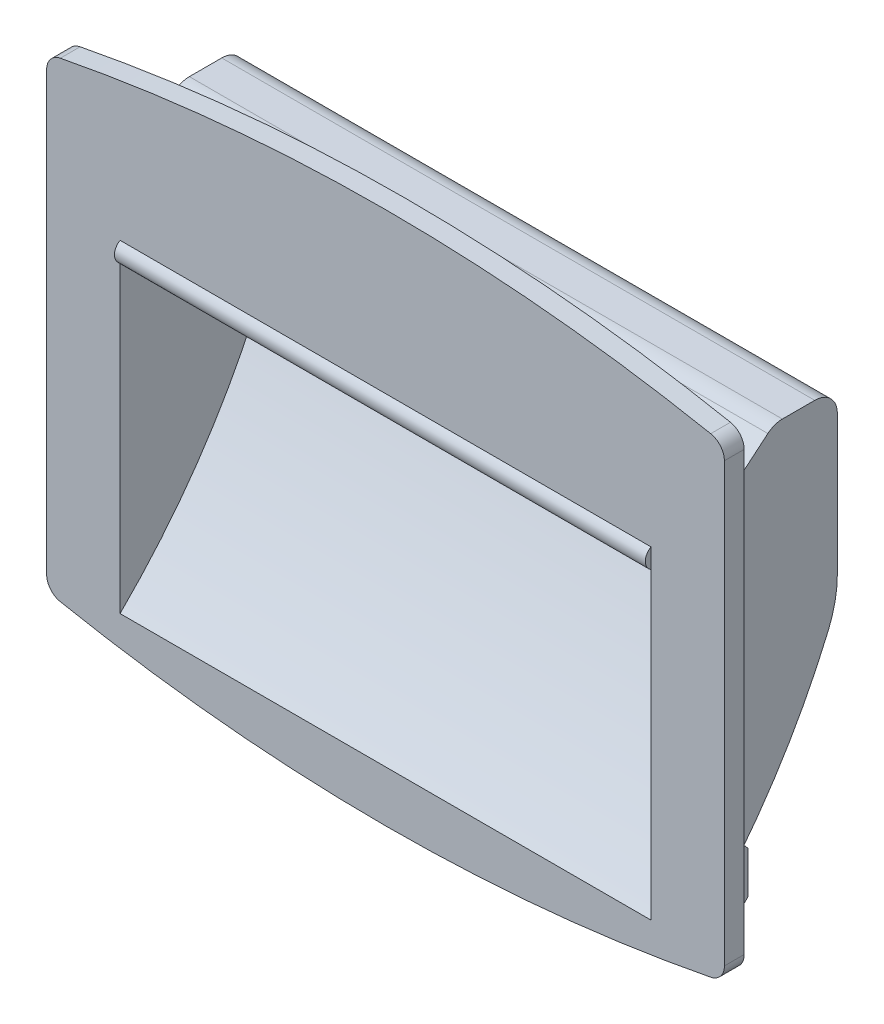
ISO-10303-21;
HEADER;
FILE_DESCRIPTION(('STEP AP214'),'2;1');
FILE_NAME('part.step','',(''),(''),'','','');
FILE_SCHEMA(('AUTOMOTIVE_DESIGN { 1 0 10303 214 1 1 1 1 }'));
ENDSEC;
DATA;
#1=APPLICATION_CONTEXT('core data for automotive mechanical design processes');
#2=APPLICATION_PROTOCOL_DEFINITION('international standard','automotive_design',2000,#1);
#3=PRODUCT_CONTEXT('',#1,'mechanical');
#4=PRODUCT('Part','Part','',(#3));
#5=PRODUCT_RELATED_PRODUCT_CATEGORY('part','',(#4));
#6=PRODUCT_DEFINITION_FORMATION('','',#4);
#7=PRODUCT_DEFINITION_CONTEXT('part definition',#1,'design');
#8=PRODUCT_DEFINITION('design','',#6,#7);
#9=PRODUCT_DEFINITION_SHAPE('','',#8);
#10=(LENGTH_UNIT() NAMED_UNIT(*) SI_UNIT(.MILLI.,.METRE.));
#11=(NAMED_UNIT(*) PLANE_ANGLE_UNIT() SI_UNIT($,.RADIAN.));
#12=(NAMED_UNIT(*) SI_UNIT($,.STERADIAN.) SOLID_ANGLE_UNIT());
#13=UNCERTAINTY_MEASURE_WITH_UNIT(LENGTH_MEASURE(1.E-05),#10,'distance_accuracy_value','');
#14=(GEOMETRIC_REPRESENTATION_CONTEXT(3) GLOBAL_UNCERTAINTY_ASSIGNED_CONTEXT((#13)) GLOBAL_UNIT_ASSIGNED_CONTEXT((#10,
#11,#12)) REPRESENTATION_CONTEXT('',''));
#15=CARTESIAN_POINT('',(0.,0.,0.));
#16=DIRECTION('',(0.,0.,1.));
#17=DIRECTION('',(1.,0.,0.));
#18=AXIS2_PLACEMENT_3D('',#15,#16,#17);
#19=CARTESIAN_POINT('',(-57.,-38.7289872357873,3.5));
#20=DIRECTION('',(0.,0.,1.));
#21=DIRECTION('',(1.,0.,0.));
#22=AXIS2_PLACEMENT_3D('',#19,#20,#21);
#23=PLANE('',#22);
#24=DIRECTION('',(0.,-1.,0.));
#25=VECTOR('',#24,1.);
#26=CARTESIAN_POINT('',(-60.,38.728987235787,3.5));
#27=LINE('',#26,#25);
#28=CARTESIAN_POINT('',(-60.,38.728987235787,3.5));
#29=VERTEX_POINT('',#28);
#30=CARTESIAN_POINT('',(-60.,-38.728987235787,3.5));
#31=VERTEX_POINT('',#30);
#32=EDGE_CURVE('E607',#29,#31,#27,.T.);
#33=ORIENTED_EDGE('',*,*,#32,.T.);
#34=CARTESIAN_POINT('',(-57.,-38.7289872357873,3.5));
#35=DIRECTION('',(0.,0.,1.));
#36=DIRECTION('',(1.,0.,0.));
#37=AXIS2_PLACEMENT_3D('',#34,#35,#36);
#38=CIRCLE('',#37,2.99999999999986);
#39=CARTESIAN_POINT('',(-57.575757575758,-41.673219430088,3.5));
#40=VERTEX_POINT('',#39);
#41=EDGE_CURVE('E608',#31,#40,#38,.T.);
#42=ORIENTED_EDGE('',*,*,#41,.T.);
#43=CARTESIAN_POINT('',(0.,252.750000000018,3.5));
#44=DIRECTION('',(0.,0.,1.));
#45=DIRECTION('',(1.,0.,0.));
#46=AXIS2_PLACEMENT_3D('',#43,#44,#45);
#47=CIRCLE('',#46,300.000000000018);
#48=CARTESIAN_POINT('',(57.575757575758,-41.673219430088,3.5));
#49=VERTEX_POINT('',#48);
#50=EDGE_CURVE('E612',#40,#49,#47,.T.);
#51=ORIENTED_EDGE('',*,*,#50,.T.);
#52=CARTESIAN_POINT('',(57.,-38.7289872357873,3.5));
#53=DIRECTION('',(0.,0.,1.));
#54=DIRECTION('',(-1.,0.,0.));
#55=AXIS2_PLACEMENT_3D('',#52,#53,#54);
#56=CIRCLE('',#55,2.99999999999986);
#57=CARTESIAN_POINT('',(60.,-38.728987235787,3.5));
#58=VERTEX_POINT('',#57);
#59=EDGE_CURVE('E616',#49,#58,#56,.T.);
#60=ORIENTED_EDGE('',*,*,#59,.T.);
#61=DIRECTION('',(0.,1.,0.));
#62=VECTOR('',#61,1.);
#63=CARTESIAN_POINT('',(60.,-38.728987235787,3.5));
#64=LINE('',#63,#62);
#65=CARTESIAN_POINT('',(60.,38.728987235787,3.5));
#66=VERTEX_POINT('',#65);
#67=EDGE_CURVE('E620',#58,#66,#64,.T.);
#68=ORIENTED_EDGE('',*,*,#67,.T.);
#69=CARTESIAN_POINT('',(57.,38.7289872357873,3.5));
#70=DIRECTION('',(0.,0.,1.));
#71=DIRECTION('',(1.,0.,0.));
#72=AXIS2_PLACEMENT_3D('',#69,#70,#71);
#73=CIRCLE('',#72,2.99999999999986);
#74=CARTESIAN_POINT('',(57.575757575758,41.673219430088,3.5));
#75=VERTEX_POINT('',#74);
#76=EDGE_CURVE('E624',#66,#75,#73,.T.);
#77=ORIENTED_EDGE('',*,*,#76,.T.);
#78=CARTESIAN_POINT('',(0.,-252.750000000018,3.5));
#79=DIRECTION('',(0.,0.,1.));
#80=DIRECTION('',(1.,0.,0.));
#81=AXIS2_PLACEMENT_3D('',#78,#79,#80);
#82=CIRCLE('',#81,300.000000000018);
#83=CARTESIAN_POINT('',(-57.575757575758,41.673219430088,3.5));
#84=VERTEX_POINT('',#83);
#85=EDGE_CURVE('E628',#75,#84,#82,.T.);
#86=ORIENTED_EDGE('',*,*,#85,.T.);
#87=CARTESIAN_POINT('',(-57.,38.7289872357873,3.5));
#88=DIRECTION('',(0.,0.,1.));
#89=DIRECTION('',(1.,0.,0.));
#90=AXIS2_PLACEMENT_3D('',#87,#88,#89);
#91=CIRCLE('',#90,2.99999999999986);
#92=EDGE_CURVE('E632',#84,#29,#91,.T.);
#93=ORIENTED_EDGE('',*,*,#92,.T.);
#94=EDGE_LOOP('',(#33,#42,#51,#60,#68,#77,#86,#93));
#95=FACE_BOUND('',#94,.T.);
#96=DIRECTION('',(1.,0.,0.));
#97=VECTOR('',#96,1.);
#98=CARTESIAN_POINT('',(-47.,19.0320508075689,3.5));
#99=LINE('',#98,#97);
#100=CARTESIAN_POINT('',(47.,19.0320508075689,3.5));
#101=VERTEX_POINT('',#100);
#102=CARTESIAN_POINT('',(-47.,19.0320508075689,3.5));
#103=VERTEX_POINT('',#102);
#104=EDGE_CURVE('E29',#101,#103,#99,.F.);
#105=ORIENTED_EDGE('',*,*,#104,.F.);
#106=DIRECTION('',(0.,1.,0.));
#107=VECTOR('',#106,1.);
#108=CARTESIAN_POINT('',(47.,-38.7289872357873,3.5));
#109=LINE('',#108,#107);
#110=CARTESIAN_POINT('',(47.,15.5679491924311,3.5));
#111=VERTEX_POINT('',#110);
#112=EDGE_CURVE('E9',#111,#101,#109,.T.);
#113=ORIENTED_EDGE('',*,*,#112,.F.);
#114=DIRECTION('',(1.,0.,0.));
#115=VECTOR('',#114,1.);
#116=CARTESIAN_POINT('',(-47.,15.5679491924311,3.5));
#117=LINE('',#116,#115);
#118=CARTESIAN_POINT('',(-47.,15.5679491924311,3.5));
#119=VERTEX_POINT('',#118);
#120=EDGE_CURVE('E36',#119,#111,#117,.T.);
#121=ORIENTED_EDGE('',*,*,#120,.F.);
#122=DIRECTION('',(0.,1.,0.));
#123=VECTOR('',#122,1.);
#124=CARTESIAN_POINT('',(-47.,-38.7289872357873,3.5));
#125=LINE('',#124,#123);
#126=EDGE_CURVE('E22',#119,#103,#125,.T.);
#127=ORIENTED_EDGE('',*,*,#126,.T.);
#128=EDGE_LOOP('',(#105,#113,#121,#127));
#129=FACE_BOUND('',#128,.T.);
#130=DIRECTION('',(0.,-1.,0.));
#131=VECTOR('',#130,1.);
#132=CARTESIAN_POINT('',(47.,15.549633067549,3.5));
#133=LINE('',#132,#131);
#134=CARTESIAN_POINT('',(47.,15.549633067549,3.5));
#135=VERTEX_POINT('',#134);
#136=CARTESIAN_POINT('',(47.,-38.2,3.50000000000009));
#137=VERTEX_POINT('',#136);
#138=EDGE_CURVE('E367',#135,#137,#133,.T.);
#139=ORIENTED_EDGE('',*,*,#138,.T.);
#140=DIRECTION('',(1.,0.,0.));
#141=VECTOR('',#140,1.);
#142=CARTESIAN_POINT('',(-47.,-38.2,3.50000000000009));
#143=LINE('',#142,#141);
#144=CARTESIAN_POINT('',(-47.,-38.2,3.50000000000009));
#145=VERTEX_POINT('',#144);
#146=EDGE_CURVE('E349',#145,#137,#143,.T.);
#147=ORIENTED_EDGE('',*,*,#146,.F.);
#148=DIRECTION('',(0.,-1.,0.));
#149=VECTOR('',#148,1.);
#150=CARTESIAN_POINT('',(-47.,15.549633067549,3.5));
#151=LINE('',#150,#149);
#152=CARTESIAN_POINT('',(-47.,15.549633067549,3.5));
#153=VERTEX_POINT('',#152);
#154=EDGE_CURVE('E381',#153,#145,#151,.T.);
#155=ORIENTED_EDGE('',*,*,#154,.F.);
#156=DIRECTION('',(1.,0.,0.));
#157=VECTOR('',#156,1.);
#158=CARTESIAN_POINT('',(-47.,15.549633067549,3.5));
#159=LINE('',#158,#157);
#160=EDGE_CURVE('E372',#153,#135,#159,.T.);
#161=ORIENTED_EDGE('',*,*,#160,.T.);
#162=EDGE_LOOP('',(#139,#147,#155,#161));
#163=FACE_BOUND('',#162,.T.);
#164=ADVANCED_FACE('F14',(#95,#129,#163),#23,.T.);
#165=CARTESIAN_POINT('',(-57.,-38.7289872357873,0.));
#166=DIRECTION('',(0.,0.,1.));
#167=DIRECTION('',(1.,0.,0.));
#168=AXIS2_PLACEMENT_3D('',#165,#166,#167);
#169=PLANE('',#168);
#170=DIRECTION('',(0.,-1.,0.));
#171=VECTOR('',#170,1.);
#172=CARTESIAN_POINT('',(-60.,38.728987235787,0.));
#173=LINE('',#172,#171);
#174=CARTESIAN_POINT('',(-60.,38.728987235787,0.));
#175=VERTEX_POINT('',#174);
#176=CARTESIAN_POINT('',(-60.,-38.728987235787,0.));
#177=VERTEX_POINT('',#176);
#178=EDGE_CURVE('E636',#175,#177,#173,.T.);
#179=ORIENTED_EDGE('',*,*,#178,.F.);
#180=CARTESIAN_POINT('',(-57.,38.7289872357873,0.));
#181=DIRECTION('',(0.,0.,1.));
#182=DIRECTION('',(1.,0.,0.));
#183=AXIS2_PLACEMENT_3D('',#180,#181,#182);
#184=CIRCLE('',#183,2.99999999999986);
#185=CARTESIAN_POINT('',(-57.575757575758,41.673219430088,0.));
#186=VERTEX_POINT('',#185);
#187=EDGE_CURVE('E658',#186,#175,#184,.T.);
#188=ORIENTED_EDGE('',*,*,#187,.F.);
#189=CARTESIAN_POINT('',(0.,-252.750000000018,0.));
#190=DIRECTION('',(0.,0.,1.));
#191=DIRECTION('',(1.,0.,0.));
#192=AXIS2_PLACEMENT_3D('',#189,#190,#191);
#193=CIRCLE('',#192,300.000000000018);
#194=CARTESIAN_POINT('',(57.575757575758,41.673219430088,0.));
#195=VERTEX_POINT('',#194);
#196=EDGE_CURVE('E655',#195,#186,#193,.T.);
#197=ORIENTED_EDGE('',*,*,#196,.F.);
#198=CARTESIAN_POINT('',(57.,38.7289872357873,0.));
#199=DIRECTION('',(0.,0.,1.));
#200=DIRECTION('',(1.,0.,0.));
#201=AXIS2_PLACEMENT_3D('',#198,#199,#200);
#202=CIRCLE('',#201,2.99999999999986);
#203=CARTESIAN_POINT('',(60.,38.728987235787,0.));
#204=VERTEX_POINT('',#203);
#205=EDGE_CURVE('E652',#204,#195,#202,.T.);
#206=ORIENTED_EDGE('',*,*,#205,.F.);
#207=DIRECTION('',(0.,1.,0.));
#208=VECTOR('',#207,1.);
#209=CARTESIAN_POINT('',(60.,-38.728987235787,0.));
#210=LINE('',#209,#208);
#211=CARTESIAN_POINT('',(60.,-38.728987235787,0.));
#212=VERTEX_POINT('',#211);
#213=EDGE_CURVE('E649',#212,#204,#210,.T.);
#214=ORIENTED_EDGE('',*,*,#213,.F.);
#215=CARTESIAN_POINT('',(57.,-38.7289872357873,0.));
#216=DIRECTION('',(0.,0.,1.));
#217=DIRECTION('',(-1.,0.,0.));
#218=AXIS2_PLACEMENT_3D('',#215,#216,#217);
#219=CIRCLE('',#218,2.99999999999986);
#220=CARTESIAN_POINT('',(57.575757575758,-41.673219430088,0.));
#221=VERTEX_POINT('',#220);
#222=EDGE_CURVE('E646',#221,#212,#219,.T.);
#223=ORIENTED_EDGE('',*,*,#222,.F.);
#224=CARTESIAN_POINT('',(0.,252.750000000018,0.));
#225=DIRECTION('',(0.,0.,1.));
#226=DIRECTION('',(1.,0.,0.));
#227=AXIS2_PLACEMENT_3D('',#224,#225,#226);
#228=CIRCLE('',#227,300.000000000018);
#229=CARTESIAN_POINT('',(-57.575757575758,-41.673219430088,0.));
#230=VERTEX_POINT('',#229);
#231=EDGE_CURVE('E643',#230,#221,#228,.T.);
#232=ORIENTED_EDGE('',*,*,#231,.F.);
#233=CARTESIAN_POINT('',(-57.,-38.7289872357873,0.));
#234=DIRECTION('',(0.,0.,1.));
#235=DIRECTION('',(1.,0.,0.));
#236=AXIS2_PLACEMENT_3D('',#233,#234,#235);
#237=CIRCLE('',#236,2.99999999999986);
#238=EDGE_CURVE('E640',#177,#230,#237,.T.);
#239=ORIENTED_EDGE('',*,*,#238,.F.);
#240=EDGE_LOOP('',(#179,#188,#197,#206,#214,#223,#232,#239));
#241=FACE_BOUND('',#240,.T.);
#242=DIRECTION('',(0.,-1.,0.));
#243=VECTOR('',#242,1.);
#244=CARTESIAN_POINT('',(40.,-38.7289872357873,0.));
#245=LINE('',#244,#243);
#246=CARTESIAN_POINT('',(40.,30.75,0.));
#247=VERTEX_POINT('',#246);
#248=CARTESIAN_POINT('',(40.,21.75,0.));
#249=VERTEX_POINT('',#248);
#250=EDGE_CURVE('E498',#247,#249,#245,.T.);
#251=ORIENTED_EDGE('',*,*,#250,.F.);
#252=DIRECTION('',(-1.,0.,0.));
#253=VECTOR('',#252,1.);
#254=CARTESIAN_POINT('',(-57.,30.75,0.));
#255=LINE('',#254,#253);
#256=CARTESIAN_POINT('',(38.,30.75,0.));
#257=VERTEX_POINT('',#256);
#258=EDGE_CURVE('E461',#247,#257,#255,.T.);
#259=ORIENTED_EDGE('',*,*,#258,.T.);
#260=DIRECTION('',(0.,1.,0.));
#261=VECTOR('',#260,1.);
#262=CARTESIAN_POINT('',(38.,-38.7289872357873,0.));
#263=LINE('',#262,#261);
#264=CARTESIAN_POINT('',(38.,21.75,0.));
#265=VERTEX_POINT('',#264);
#266=EDGE_CURVE('E495',#265,#257,#263,.T.);
#267=ORIENTED_EDGE('',*,*,#266,.F.);
#268=DIRECTION('',(1.,0.,0.));
#269=VECTOR('',#268,1.);
#270=CARTESIAN_POINT('',(-52.5,21.75,0.));
#271=LINE('',#270,#269);
#272=CARTESIAN_POINT('',(27.,21.75,0.));
#273=VERTEX_POINT('',#272);
#274=EDGE_CURVE('E862',#273,#265,#271,.T.);
#275=ORIENTED_EDGE('',*,*,#274,.F.);
#276=DIRECTION('',(0.,-1.,0.));
#277=VECTOR('',#276,1.);
#278=CARTESIAN_POINT('',(27.,-38.7289872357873,0.));
#279=LINE('',#278,#277);
#280=CARTESIAN_POINT('',(27.,30.75,0.));
#281=VERTEX_POINT('',#280);
#282=EDGE_CURVE('E492',#281,#273,#279,.T.);
#283=ORIENTED_EDGE('',*,*,#282,.F.);
#284=CARTESIAN_POINT('',(25.,30.75,0.));
#285=VERTEX_POINT('',#284);
#286=EDGE_CURVE('E817',#281,#285,#255,.T.);
#287=ORIENTED_EDGE('',*,*,#286,.T.);
#288=DIRECTION('',(0.,1.,0.));
#289=VECTOR('',#288,1.);
#290=CARTESIAN_POINT('',(25.,-38.7289872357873,0.));
#291=LINE('',#290,#289);
#292=CARTESIAN_POINT('',(25.,21.75,0.));
#293=VERTEX_POINT('',#292);
#294=EDGE_CURVE('E489',#293,#285,#291,.T.);
#295=ORIENTED_EDGE('',*,*,#294,.F.);
#296=CARTESIAN_POINT('',(14.,21.75,0.));
#297=VERTEX_POINT('',#296);
#298=EDGE_CURVE('E858',#297,#293,#271,.T.);
#299=ORIENTED_EDGE('',*,*,#298,.F.);
#300=DIRECTION('',(0.,-1.,0.));
#301=VECTOR('',#300,1.);
#302=CARTESIAN_POINT('',(14.,-38.7289872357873,0.));
#303=LINE('',#302,#301);
#304=CARTESIAN_POINT('',(14.,30.75,0.));
#305=VERTEX_POINT('',#304);
#306=EDGE_CURVE('E486',#305,#297,#303,.T.);
#307=ORIENTED_EDGE('',*,*,#306,.F.);
#308=CARTESIAN_POINT('',(12.,30.75,0.));
#309=VERTEX_POINT('',#308);
#310=EDGE_CURVE('E1018',#305,#309,#255,.T.);
#311=ORIENTED_EDGE('',*,*,#310,.T.);
#312=DIRECTION('',(0.,1.,0.));
#313=VECTOR('',#312,1.);
#314=CARTESIAN_POINT('',(12.,-38.7289872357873,0.));
#315=LINE('',#314,#313);
#316=CARTESIAN_POINT('',(12.,21.75,0.));
#317=VERTEX_POINT('',#316);
#318=EDGE_CURVE('E483',#317,#309,#315,.T.);
#319=ORIENTED_EDGE('',*,*,#318,.F.);
#320=CARTESIAN_POINT('',(0.999999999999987,21.75,0.));
#321=VERTEX_POINT('',#320);
#322=EDGE_CURVE('E854',#321,#317,#271,.T.);
#323=ORIENTED_EDGE('',*,*,#322,.F.);
#324=DIRECTION('',(0.,-1.,0.));
#325=VECTOR('',#324,1.);
#326=CARTESIAN_POINT('',(1.,-38.7289872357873,0.));
#327=LINE('',#326,#325);
#328=CARTESIAN_POINT('',(1.,30.75,0.));
#329=VERTEX_POINT('',#328);
#330=EDGE_CURVE('E480',#329,#321,#327,.T.);
#331=ORIENTED_EDGE('',*,*,#330,.F.);
#332=CARTESIAN_POINT('',(-1.,30.75,0.));
#333=VERTEX_POINT('',#332);
#334=EDGE_CURVE('E1019',#329,#333,#255,.T.);
#335=ORIENTED_EDGE('',*,*,#334,.T.);
#336=DIRECTION('',(0.,1.,0.));
#337=VECTOR('',#336,1.);
#338=CARTESIAN_POINT('',(-1.,-38.7289872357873,0.));
#339=LINE('',#338,#337);
#340=CARTESIAN_POINT('',(-1.00000000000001,21.75,0.));
#341=VERTEX_POINT('',#340);
#342=EDGE_CURVE('E477',#341,#333,#339,.T.);
#343=ORIENTED_EDGE('',*,*,#342,.F.);
#344=CARTESIAN_POINT('',(-12.,21.75,0.));
#345=VERTEX_POINT('',#344);
#346=EDGE_CURVE('E850',#345,#341,#271,.T.);
#347=ORIENTED_EDGE('',*,*,#346,.F.);
#348=DIRECTION('',(0.,-1.,0.));
#349=VECTOR('',#348,1.);
#350=CARTESIAN_POINT('',(-12.,-38.7289872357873,0.));
#351=LINE('',#350,#349);
#352=CARTESIAN_POINT('',(-12.,30.75,0.));
#353=VERTEX_POINT('',#352);
#354=EDGE_CURVE('E474',#353,#345,#351,.T.);
#355=ORIENTED_EDGE('',*,*,#354,.F.);
#356=CARTESIAN_POINT('',(-14.,30.75,0.));
#357=VERTEX_POINT('',#356);
#358=EDGE_CURVE('E1021',#353,#357,#255,.T.);
#359=ORIENTED_EDGE('',*,*,#358,.T.);
#360=DIRECTION('',(0.,1.,0.));
#361=VECTOR('',#360,1.);
#362=CARTESIAN_POINT('',(-14.,-38.7289872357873,0.));
#363=LINE('',#362,#361);
#364=CARTESIAN_POINT('',(-14.,21.75,0.));
#365=VERTEX_POINT('',#364);
#366=EDGE_CURVE('E471',#365,#357,#363,.T.);
#367=ORIENTED_EDGE('',*,*,#366,.F.);
#368=CARTESIAN_POINT('',(-25.,21.75,0.));
#369=VERTEX_POINT('',#368);
#370=EDGE_CURVE('E848',#369,#365,#271,.T.);
#371=ORIENTED_EDGE('',*,*,#370,.F.);
#372=DIRECTION('',(0.,-1.,0.));
#373=VECTOR('',#372,1.);
#374=CARTESIAN_POINT('',(-25.,-38.7289872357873,0.));
#375=LINE('',#374,#373);
#376=CARTESIAN_POINT('',(-25.,30.75,0.));
#377=VERTEX_POINT('',#376);
#378=EDGE_CURVE('E468',#377,#369,#375,.T.);
#379=ORIENTED_EDGE('',*,*,#378,.F.);
#380=CARTESIAN_POINT('',(-27.,30.75,0.));
#381=VERTEX_POINT('',#380);
#382=EDGE_CURVE('E460',#377,#381,#255,.T.);
#383=ORIENTED_EDGE('',*,*,#382,.T.);
#384=DIRECTION('',(0.,1.,0.));
#385=VECTOR('',#384,1.);
#386=CARTESIAN_POINT('',(-27.,-38.7289872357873,0.));
#387=LINE('',#386,#385);
#388=CARTESIAN_POINT('',(-27.,21.75,0.));
#389=VERTEX_POINT('',#388);
#390=EDGE_CURVE('E465',#389,#381,#387,.T.);
#391=ORIENTED_EDGE('',*,*,#390,.F.);
#392=CARTESIAN_POINT('',(-38.,21.75,0.));
#393=VERTEX_POINT('',#392);
#394=EDGE_CURVE('E593',#393,#389,#271,.T.);
#395=ORIENTED_EDGE('',*,*,#394,.F.);
#396=DIRECTION('',(0.,-1.,0.));
#397=VECTOR('',#396,1.);
#398=CARTESIAN_POINT('',(-38.,-38.7289872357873,0.));
#399=LINE('',#398,#397);
#400=CARTESIAN_POINT('',(-38.,30.75,0.));
#401=VERTEX_POINT('',#400);
#402=EDGE_CURVE('E462',#401,#393,#399,.T.);
#403=ORIENTED_EDGE('',*,*,#402,.F.);
#404=CARTESIAN_POINT('',(-40.,30.75,0.));
#405=VERTEX_POINT('',#404);
#406=EDGE_CURVE('E456',#401,#405,#255,.T.);
#407=ORIENTED_EDGE('',*,*,#406,.T.);
#408=DIRECTION('',(0.,1.,0.));
#409=VECTOR('',#408,1.);
#410=CARTESIAN_POINT('',(-40.,-38.7289872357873,0.));
#411=LINE('',#410,#409);
#412=CARTESIAN_POINT('',(-40.,21.75,0.));
#413=VERTEX_POINT('',#412);
#414=EDGE_CURVE('E501',#413,#405,#411,.T.);
#415=ORIENTED_EDGE('',*,*,#414,.F.);
#416=CARTESIAN_POINT('',(-52.5,21.75,0.));
#417=VERTEX_POINT('',#416);
#418=EDGE_CURVE('E589',#417,#413,#271,.T.);
#419=ORIENTED_EDGE('',*,*,#418,.F.);
#420=DIRECTION('',(0.,-1.,0.));
#421=VECTOR('',#420,1.);
#422=CARTESIAN_POINT('',(-52.5,21.75,0.));
#423=LINE('',#422,#421);
#424=CARTESIAN_POINT('',(-52.5,-38.2,1.10154940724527E-13));
#425=VERTEX_POINT('',#424);
#426=EDGE_CURVE('E563',#417,#425,#423,.T.);
#427=ORIENTED_EDGE('',*,*,#426,.T.);
#428=DIRECTION('',(1.,0.,0.));
#429=VECTOR('',#428,1.);
#430=CARTESIAN_POINT('',(-52.5,-38.2,1.10154940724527E-13));
#431=LINE('',#430,#429);
#432=CARTESIAN_POINT('',(52.5,-38.2,0.));
#433=VERTEX_POINT('',#432);
#434=EDGE_CURVE('E605',#425,#433,#431,.T.);
#435=ORIENTED_EDGE('',*,*,#434,.T.);
#436=DIRECTION('',(0.,-1.,0.));
#437=VECTOR('',#436,1.);
#438=CARTESIAN_POINT('',(52.5,21.75,0.));
#439=LINE('',#438,#437);
#440=CARTESIAN_POINT('',(52.5,21.75,0.));
#441=VERTEX_POINT('',#440);
#442=EDGE_CURVE('E541',#441,#433,#439,.T.);
#443=ORIENTED_EDGE('',*,*,#442,.F.);
#444=EDGE_CURVE('E586',#249,#441,#271,.T.);
#445=ORIENTED_EDGE('',*,*,#444,.F.);
#446=EDGE_LOOP('',(#251,#259,#267,#275,#283,#287,#295,#299,#307,#311,#319,#323,#331,#335,#343,
#347,#355,#359,#367,#371,#379,#383,#391,#395,#403,#407,#415,#419,#427,#435,#443,#445));
#447=FACE_BOUND('',#446,.T.);
#448=ADVANCED_FACE('F745',(#241,#447),#169,.F.);
#449=CARTESIAN_POINT('',(-52.5,31.564177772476,-11.696081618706));
#450=DIRECTION('',(0.,0.766044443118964,0.642787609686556));
#451=DIRECTION('',(0.,-0.642787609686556,0.766044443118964));
#452=AXIS2_PLACEMENT_3D('',#449,#450,#451);
#453=PLANE('',#452);
#454=DIRECTION('',(-1.,0.,0.));
#455=VECTOR('',#454,1.);
#456=CARTESIAN_POINT('',(-52.5,30.75,-10.7257823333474));
#457=LINE('',#456,#455);
#458=CARTESIAN_POINT('',(40.,30.75,-10.7257823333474));
#459=VERTEX_POINT('',#458);
#460=CARTESIAN_POINT('',(38.,30.75,-10.7257823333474));
#461=VERTEX_POINT('',#460);
#462=EDGE_CURVE('E692',#459,#461,#457,.T.);
#463=ORIENTED_EDGE('',*,*,#462,.F.);
#464=DIRECTION('',(0.,-0.642787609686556,0.766044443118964));
#465=VECTOR('',#464,1.);
#466=CARTESIAN_POINT('',(40.,31.564177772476,-11.696081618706));
#467=LINE('',#466,#465);
#468=EDGE_CURVE('E723',#459,#249,#467,.T.);
#469=ORIENTED_EDGE('',*,*,#468,.T.);
#470=ORIENTED_EDGE('',*,*,#444,.T.);
#471=DIRECTION('',(0.,-0.642787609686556,0.766044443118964));
#472=VECTOR('',#471,1.);
#473=CARTESIAN_POINT('',(52.5,31.564177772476,-11.696081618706));
#474=LINE('',#473,#472);
#475=CARTESIAN_POINT('',(52.5,31.564177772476,-11.696081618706));
#476=VERTEX_POINT('',#475);
#477=EDGE_CURVE('E560',#476,#441,#474,.T.);
#478=ORIENTED_EDGE('',*,*,#477,.F.);
#479=DIRECTION('',(1.,0.,0.));
#480=VECTOR('',#479,1.);
#481=CARTESIAN_POINT('',(-52.5,31.564177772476,-11.696081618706));
#482=LINE('',#481,#480);
#483=CARTESIAN_POINT('',(-52.5,31.564177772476,-11.696081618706));
#484=VERTEX_POINT('',#483);
#485=EDGE_CURVE('E592',#484,#476,#482,.T.);
#486=ORIENTED_EDGE('',*,*,#485,.F.);
#487=DIRECTION('',(0.,-0.642787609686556,0.766044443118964));
#488=VECTOR('',#487,1.);
#489=CARTESIAN_POINT('',(-52.5,31.564177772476,-11.696081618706));
#490=LINE('',#489,#488);
#491=EDGE_CURVE('E584',#484,#417,#490,.T.);
#492=ORIENTED_EDGE('',*,*,#491,.T.);
#493=ORIENTED_EDGE('',*,*,#418,.T.);
#494=DIRECTION('',(0.,0.642787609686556,-0.766044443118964));
#495=VECTOR('',#494,1.);
#496=CARTESIAN_POINT('',(-40.,31.564177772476,-11.696081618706));
#497=LINE('',#496,#495);
#498=CARTESIAN_POINT('',(-40.,30.75,-10.7257823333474));
#499=VERTEX_POINT('',#498);
#500=EDGE_CURVE('E695',#413,#499,#497,.T.);
#501=ORIENTED_EDGE('',*,*,#500,.T.);
#502=CARTESIAN_POINT('',(-38.,30.75,-10.7257823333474));
#503=VERTEX_POINT('',#502);
#504=EDGE_CURVE('E688',#503,#499,#457,.T.);
#505=ORIENTED_EDGE('',*,*,#504,.F.);
#506=DIRECTION('',(0.,-0.642787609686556,0.766044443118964));
#507=VECTOR('',#506,1.);
#508=CARTESIAN_POINT('',(-38.,31.564177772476,-11.696081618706));
#509=LINE('',#508,#507);
#510=EDGE_CURVE('E691',#503,#393,#509,.T.);
#511=ORIENTED_EDGE('',*,*,#510,.T.);
#512=ORIENTED_EDGE('',*,*,#394,.T.);
#513=DIRECTION('',(0.,0.642787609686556,-0.766044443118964));
#514=VECTOR('',#513,1.);
#515=CARTESIAN_POINT('',(-27.,31.564177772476,-11.696081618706));
#516=LINE('',#515,#514);
#517=CARTESIAN_POINT('',(-27.,30.75,-10.7257823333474));
#518=VERTEX_POINT('',#517);
#519=EDGE_CURVE('E697',#389,#518,#516,.T.);
#520=ORIENTED_EDGE('',*,*,#519,.T.);
#521=CARTESIAN_POINT('',(-25.,30.75,-10.7257823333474));
#522=VERTEX_POINT('',#521);
#523=EDGE_CURVE('E693',#522,#518,#457,.T.);
#524=ORIENTED_EDGE('',*,*,#523,.F.);
#525=DIRECTION('',(0.,-0.642787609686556,0.766044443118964));
#526=VECTOR('',#525,1.);
#527=CARTESIAN_POINT('',(-25.,31.564177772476,-11.696081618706));
#528=LINE('',#527,#526);
#529=EDGE_CURVE('E699',#522,#369,#528,.T.);
#530=ORIENTED_EDGE('',*,*,#529,.T.);
#531=ORIENTED_EDGE('',*,*,#370,.T.);
#532=DIRECTION('',(0.,0.642787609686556,-0.766044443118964));
#533=VECTOR('',#532,1.);
#534=CARTESIAN_POINT('',(-14.,31.564177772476,-11.696081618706));
#535=LINE('',#534,#533);
#536=CARTESIAN_POINT('',(-14.,30.75,-10.7257823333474));
#537=VERTEX_POINT('',#536);
#538=EDGE_CURVE('E702',#365,#537,#535,.T.);
#539=ORIENTED_EDGE('',*,*,#538,.T.);
#540=CARTESIAN_POINT('',(-12.,30.75,-10.7257823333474));
#541=VERTEX_POINT('',#540);
#542=EDGE_CURVE('E701',#541,#537,#457,.T.);
#543=ORIENTED_EDGE('',*,*,#542,.F.);
#544=DIRECTION('',(0.,-0.642787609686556,0.766044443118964));
#545=VECTOR('',#544,1.);
#546=CARTESIAN_POINT('',(-12.,31.564177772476,-11.696081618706));
#547=LINE('',#546,#545);
#548=EDGE_CURVE('E704',#541,#345,#547,.T.);
#549=ORIENTED_EDGE('',*,*,#548,.T.);
#550=ORIENTED_EDGE('',*,*,#346,.T.);
#551=DIRECTION('',(0.,0.642787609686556,-0.766044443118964));
#552=VECTOR('',#551,1.);
#553=CARTESIAN_POINT('',(-1.,31.564177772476,-11.696081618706));
#554=LINE('',#553,#552);
#555=CARTESIAN_POINT('',(-1.,30.75,-10.7257823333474));
#556=VERTEX_POINT('',#555);
#557=EDGE_CURVE('E707',#341,#556,#554,.T.);
#558=ORIENTED_EDGE('',*,*,#557,.T.);
#559=CARTESIAN_POINT('',(0.999999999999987,30.75,-10.7257823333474));
#560=VERTEX_POINT('',#559);
#561=EDGE_CURVE('E706',#560,#556,#457,.T.);
#562=ORIENTED_EDGE('',*,*,#561,.F.);
#563=DIRECTION('',(0.,-0.642787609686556,0.766044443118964));
#564=VECTOR('',#563,1.);
#565=CARTESIAN_POINT('',(1.,31.564177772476,-11.696081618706));
#566=LINE('',#565,#564);
#567=EDGE_CURVE('E709',#560,#321,#566,.T.);
#568=ORIENTED_EDGE('',*,*,#567,.T.);
#569=ORIENTED_EDGE('',*,*,#322,.T.);
#570=DIRECTION('',(0.,0.642787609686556,-0.766044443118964));
#571=VECTOR('',#570,1.);
#572=CARTESIAN_POINT('',(12.,31.564177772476,-11.696081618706));
#573=LINE('',#572,#571);
#574=CARTESIAN_POINT('',(12.,30.75,-10.7257823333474));
#575=VERTEX_POINT('',#574);
#576=EDGE_CURVE('E712',#317,#575,#573,.T.);
#577=ORIENTED_EDGE('',*,*,#576,.T.);
#578=CARTESIAN_POINT('',(14.,30.75,-10.7257823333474));
#579=VERTEX_POINT('',#578);
#580=EDGE_CURVE('E711',#579,#575,#457,.T.);
#581=ORIENTED_EDGE('',*,*,#580,.F.);
#582=DIRECTION('',(0.,-0.642787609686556,0.766044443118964));
#583=VECTOR('',#582,1.);
#584=CARTESIAN_POINT('',(14.,31.564177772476,-11.696081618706));
#585=LINE('',#584,#583);
#586=EDGE_CURVE('E714',#579,#297,#585,.T.);
#587=ORIENTED_EDGE('',*,*,#586,.T.);
#588=ORIENTED_EDGE('',*,*,#298,.T.);
#589=DIRECTION('',(0.,0.642787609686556,-0.766044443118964));
#590=VECTOR('',#589,1.);
#591=CARTESIAN_POINT('',(25.,31.564177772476,-11.696081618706));
#592=LINE('',#591,#590);
#593=CARTESIAN_POINT('',(25.,30.75,-10.7257823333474));
#594=VERTEX_POINT('',#593);
#595=EDGE_CURVE('E717',#293,#594,#592,.T.);
#596=ORIENTED_EDGE('',*,*,#595,.T.);
#597=CARTESIAN_POINT('',(27.,30.75,-10.7257823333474));
#598=VERTEX_POINT('',#597);
#599=EDGE_CURVE('E716',#598,#594,#457,.T.);
#600=ORIENTED_EDGE('',*,*,#599,.F.);
#601=DIRECTION('',(0.,-0.642787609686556,0.766044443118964));
#602=VECTOR('',#601,1.);
#603=CARTESIAN_POINT('',(27.,31.564177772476,-11.696081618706));
#604=LINE('',#603,#602);
#605=EDGE_CURVE('E719',#598,#273,#604,.T.);
#606=ORIENTED_EDGE('',*,*,#605,.T.);
#607=ORIENTED_EDGE('',*,*,#274,.T.);
#608=DIRECTION('',(0.,0.642787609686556,-0.766044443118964));
#609=VECTOR('',#608,1.);
#610=CARTESIAN_POINT('',(38.,31.564177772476,-11.696081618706));
#611=LINE('',#610,#609);
#612=EDGE_CURVE('E721',#265,#461,#611,.T.);
#613=ORIENTED_EDGE('',*,*,#612,.T.);
#614=EDGE_LOOP('',(#463,#469,#470,#478,#486,#492,#493,#501,#505,#511,#512,#520,#524,#530,#531,
#539,#543,#549,#550,#558,#562,#568,#569,#577,#581,#587,#588,#596,#600,#606,#607,#613));
#615=FACE_BOUND('',#614,.T.);
#616=ADVANCED_FACE('F752',(#615),#453,.T.);
#617=CARTESIAN_POINT('',(-52.5,40.8904239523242,83.4847581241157));
#618=DIRECTION('',(1.,0.,0.));
#619=DIRECTION('',(0.,0.,-1.));
#620=AXIS2_PLACEMENT_3D('',#617,#618,#619);
#621=CYLINDRICAL_SURFACE('',#620,115.000000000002);
#622=DIRECTION('',(1.,0.,0.));
#623=VECTOR('',#622,1.);
#624=CARTESIAN_POINT('',(-52.5,-3.93857227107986,-22.417843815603));
#625=LINE('',#624,#623);
#626=CARTESIAN_POINT('',(-52.5,-3.93857227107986,-22.417843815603));
#627=VERTEX_POINT('',#626);
#628=CARTESIAN_POINT('',(52.5,-3.93857227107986,-22.417843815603));
#629=VERTEX_POINT('',#628);
#630=EDGE_CURVE('E603',#627,#629,#625,.T.);
#631=ORIENTED_EDGE('',*,*,#630,.T.);
#632=CARTESIAN_POINT('',(52.5,40.8904239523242,83.4847581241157));
#633=DIRECTION('',(1.,0.,0.));
#634=DIRECTION('',(0.,1.,0.));
#635=AXIS2_PLACEMENT_3D('',#632,#633,#634);
#636=CIRCLE('',#635,115.000000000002);
#637=EDGE_CURVE('E542',#433,#629,#636,.T.);
#638=ORIENTED_EDGE('',*,*,#637,.F.);
#639=ORIENTED_EDGE('',*,*,#434,.F.);
#640=CARTESIAN_POINT('',(-52.5,40.8904239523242,83.4847581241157));
#641=DIRECTION('',(1.,0.,0.));
#642=DIRECTION('',(0.,1.,0.));
#643=AXIS2_PLACEMENT_3D('',#640,#641,#642);
#644=CIRCLE('',#643,115.000000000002);
#645=EDGE_CURVE('E566',#425,#627,#644,.T.);
#646=ORIENTED_EDGE('',*,*,#645,.T.);
#647=EDGE_LOOP('',(#631,#638,#639,#646));
#648=FACE_BOUND('',#647,.T.);
#649=DIRECTION('',(1.,0.,0.));
#650=VECTOR('',#649,1.);
#651=CARTESIAN_POINT('',(-52.5,-37.7365610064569,-0.436617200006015));
#652=LINE('',#651,#650);
#653=CARTESIAN_POINT('',(50.,-37.7365610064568,-0.436617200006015));
#654=VERTEX_POINT('',#653);
#655=CARTESIAN_POINT('',(-50.,-37.7365610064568,-0.436617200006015));
#656=VERTEX_POINT('',#655);
#657=EDGE_CURVE('E681',#654,#656,#652,.F.);
#658=ORIENTED_EDGE('',*,*,#657,.F.);
#659=CARTESIAN_POINT('',(50.,40.8904239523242,83.4847581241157));
#660=DIRECTION('',(-1.,0.,0.));
#661=DIRECTION('',(0.,-1.,0.));
#662=AXIS2_PLACEMENT_3D('',#659,#660,#661);
#663=CIRCLE('',#662,115.000000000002);
#664=CARTESIAN_POINT('',(50.,-29.2696838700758,-7.633622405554));
#665=VERTEX_POINT('',#664);
#666=EDGE_CURVE('E685',#654,#665,#663,.F.);
#667=ORIENTED_EDGE('',*,*,#666,.T.);
#668=DIRECTION('',(1.,0.,0.));
#669=VECTOR('',#668,1.);
#670=CARTESIAN_POINT('',(-52.5,-29.2696838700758,-7.633622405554));
#671=LINE('',#670,#669);
#672=CARTESIAN_POINT('',(-50.,-29.2696838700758,-7.633622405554));
#673=VERTEX_POINT('',#672);
#674=EDGE_CURVE('E679',#673,#665,#671,.T.);
#675=ORIENTED_EDGE('',*,*,#674,.F.);
#676=CARTESIAN_POINT('',(-50.,40.8904239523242,83.4847581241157));
#677=DIRECTION('',(-1.,0.,0.));
#678=DIRECTION('',(0.,-1.,0.));
#679=AXIS2_PLACEMENT_3D('',#676,#677,#678);
#680=CIRCLE('',#679,115.000000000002);
#681=EDGE_CURVE('E683',#656,#673,#680,.F.);
#682=ORIENTED_EDGE('',*,*,#681,.F.);
#683=EDGE_LOOP('',(#658,#667,#675,#682));
#684=FACE_BOUND('',#683,.T.);
#685=ADVANCED_FACE('F756',(#648,#684),#621,.T.);
#686=CARTESIAN_POINT('',(-60.,38.728987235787,0.));
#687=DIRECTION('',(-1.,0.,0.));
#688=DIRECTION('',(0.,0.,1.));
#689=AXIS2_PLACEMENT_3D('',#686,#687,#688);
#690=PLANE('',#689);
#691=ORIENTED_EDGE('',*,*,#32,.F.);
#692=DIRECTION('',(0.,0.,1.));
#693=VECTOR('',#692,1.);
#694=CARTESIAN_POINT('',(-60.,38.728987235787,0.));
#695=LINE('',#694,#693);
#696=EDGE_CURVE('E661',#175,#29,#695,.T.);
#697=ORIENTED_EDGE('',*,*,#696,.F.);
#698=ORIENTED_EDGE('',*,*,#178,.T.);
#699=DIRECTION('',(0.,0.,1.));
#700=VECTOR('',#699,1.);
#701=CARTESIAN_POINT('',(-60.,-38.728987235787,0.));
#702=LINE('',#701,#700);
#703=EDGE_CURVE('E677',#177,#31,#702,.T.);
#704=ORIENTED_EDGE('',*,*,#703,.T.);
#705=EDGE_LOOP('',(#691,#697,#698,#704));
#706=FACE_BOUND('',#705,.T.);
#707=ADVANCED_FACE('F16',(#706),#690,.T.);
#708=CARTESIAN_POINT('',(-57.,-38.7289872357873,0.));
#709=DIRECTION('',(0.,0.,1.));
#710=DIRECTION('',(1.,0.,0.));
#711=AXIS2_PLACEMENT_3D('',#708,#709,#710);
#712=CYLINDRICAL_SURFACE('',#711,2.99999999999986);
#713=ORIENTED_EDGE('',*,*,#41,.F.);
#714=ORIENTED_EDGE('',*,*,#703,.F.);
#715=ORIENTED_EDGE('',*,*,#238,.T.);
#716=DIRECTION('',(0.,0.,1.));
#717=VECTOR('',#716,1.);
#718=CARTESIAN_POINT('',(-57.575757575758,-41.673219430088,0.));
#719=LINE('',#718,#717);
#720=EDGE_CURVE('E675',#230,#40,#719,.T.);
#721=ORIENTED_EDGE('',*,*,#720,.T.);
#722=EDGE_LOOP('',(#713,#714,#715,#721));
#723=FACE_BOUND('',#722,.T.);
#724=ADVANCED_FACE('F782',(#723),#712,.T.);
#725=CARTESIAN_POINT('',(0.,252.750000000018,0.));
#726=DIRECTION('',(0.,0.,1.));
#727=DIRECTION('',(1.,0.,0.));
#728=AXIS2_PLACEMENT_3D('',#725,#726,#727);
#729=CYLINDRICAL_SURFACE('',#728,300.000000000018);
#730=ORIENTED_EDGE('',*,*,#50,.F.);
#731=ORIENTED_EDGE('',*,*,#720,.F.);
#732=ORIENTED_EDGE('',*,*,#231,.T.);
#733=DIRECTION('',(0.,0.,1.));
#734=VECTOR('',#733,1.);
#735=CARTESIAN_POINT('',(57.575757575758,-41.673219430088,0.));
#736=LINE('',#735,#734);
#737=EDGE_CURVE('E673',#221,#49,#736,.T.);
#738=ORIENTED_EDGE('',*,*,#737,.T.);
#739=EDGE_LOOP('',(#730,#731,#732,#738));
#740=FACE_BOUND('',#739,.T.);
#741=ADVANCED_FACE('F779',(#740),#729,.T.);
#742=CARTESIAN_POINT('',(57.,-38.7289872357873,0.));
#743=DIRECTION('',(0.,0.,1.));
#744=DIRECTION('',(1.,0.,0.));
#745=AXIS2_PLACEMENT_3D('',#742,#743,#744);
#746=CYLINDRICAL_SURFACE('',#745,2.99999999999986);
#747=ORIENTED_EDGE('',*,*,#59,.F.);
#748=ORIENTED_EDGE('',*,*,#737,.F.);
#749=ORIENTED_EDGE('',*,*,#222,.T.);
#750=DIRECTION('',(0.,0.,1.));
#751=VECTOR('',#750,1.);
#752=CARTESIAN_POINT('',(60.,-38.728987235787,0.));
#753=LINE('',#752,#751);
#754=EDGE_CURVE('E671',#212,#58,#753,.T.);
#755=ORIENTED_EDGE('',*,*,#754,.T.);
#756=EDGE_LOOP('',(#747,#748,#749,#755));
#757=FACE_BOUND('',#756,.T.);
#758=ADVANCED_FACE('F775',(#757),#746,.T.);
#759=CARTESIAN_POINT('',(60.,-38.728987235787,0.));
#760=DIRECTION('',(1.,0.,0.));
#761=DIRECTION('',(0.,0.,-1.));
#762=AXIS2_PLACEMENT_3D('',#759,#760,#761);
#763=PLANE('',#762);
#764=ORIENTED_EDGE('',*,*,#67,.F.);
#765=ORIENTED_EDGE('',*,*,#754,.F.);
#766=ORIENTED_EDGE('',*,*,#213,.T.);
#767=DIRECTION('',(0.,0.,1.));
#768=VECTOR('',#767,1.);
#769=CARTESIAN_POINT('',(60.,38.728987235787,0.));
#770=LINE('',#769,#768);
#771=EDGE_CURVE('E669',#204,#66,#770,.T.);
#772=ORIENTED_EDGE('',*,*,#771,.T.);
#773=EDGE_LOOP('',(#764,#765,#766,#772));
#774=FACE_BOUND('',#773,.T.);
#775=ADVANCED_FACE('F771',(#774),#763,.T.);
#776=CARTESIAN_POINT('',(57.,38.7289872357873,0.));
#777=DIRECTION('',(0.,0.,1.));
#778=DIRECTION('',(1.,0.,0.));
#779=AXIS2_PLACEMENT_3D('',#776,#777,#778);
#780=CYLINDRICAL_SURFACE('',#779,2.99999999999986);
#781=ORIENTED_EDGE('',*,*,#76,.F.);
#782=ORIENTED_EDGE('',*,*,#771,.F.);
#783=ORIENTED_EDGE('',*,*,#205,.T.);
#784=DIRECTION('',(0.,0.,1.));
#785=VECTOR('',#784,1.);
#786=CARTESIAN_POINT('',(57.575757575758,41.673219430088,0.));
#787=LINE('',#786,#785);
#788=EDGE_CURVE('E667',#195,#75,#787,.T.);
#789=ORIENTED_EDGE('',*,*,#788,.T.);
#790=EDGE_LOOP('',(#781,#782,#783,#789));
#791=FACE_BOUND('',#790,.T.);
#792=ADVANCED_FACE('F767',(#791),#780,.T.);
#793=CARTESIAN_POINT('',(0.,-252.750000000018,0.));
#794=DIRECTION('',(0.,0.,1.));
#795=DIRECTION('',(1.,0.,0.));
#796=AXIS2_PLACEMENT_3D('',#793,#794,#795);
#797=CYLINDRICAL_SURFACE('',#796,300.000000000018);
#798=ORIENTED_EDGE('',*,*,#85,.F.);
#799=ORIENTED_EDGE('',*,*,#788,.F.);
#800=ORIENTED_EDGE('',*,*,#196,.T.);
#801=DIRECTION('',(0.,0.,1.));
#802=VECTOR('',#801,1.);
#803=CARTESIAN_POINT('',(-57.575757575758,41.673219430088,0.));
#804=LINE('',#803,#802);
#805=EDGE_CURVE('E665',#186,#84,#804,.T.);
#806=ORIENTED_EDGE('',*,*,#805,.T.);
#807=EDGE_LOOP('',(#798,#799,#800,#806));
#808=FACE_BOUND('',#807,.T.);
#809=ADVANCED_FACE('F763',(#808),#797,.T.);
#810=CARTESIAN_POINT('',(-57.,38.7289872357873,0.));
#811=DIRECTION('',(0.,0.,1.));
#812=DIRECTION('',(1.,0.,0.));
#813=AXIS2_PLACEMENT_3D('',#810,#811,#812);
#814=CYLINDRICAL_SURFACE('',#813,2.99999999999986);
#815=ORIENTED_EDGE('',*,*,#92,.F.);
#816=ORIENTED_EDGE('',*,*,#805,.F.);
#817=ORIENTED_EDGE('',*,*,#187,.T.);
#818=ORIENTED_EDGE('',*,*,#696,.T.);
#819=EDGE_LOOP('',(#815,#816,#817,#818));
#820=FACE_BOUND('',#819,.T.);
#821=ADVANCED_FACE('F759',(#820),#814,.T.);
#822=CARTESIAN_POINT('',(-52.5,3.85777489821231,-3.99999999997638));
#823=DIRECTION('',(1.,0.,0.));
#824=DIRECTION('',(0.,0.,-1.));
#825=AXIS2_PLACEMENT_3D('',#822,#823,#824);
#826=CYLINDRICAL_SURFACE('',#825,20.0000000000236);
#827=DIRECTION('',(1.,0.,0.));
#828=VECTOR('',#827,1.);
#829=CARTESIAN_POINT('',(-52.5,3.8577748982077,-24.));
#830=LINE('',#829,#828);
#831=CARTESIAN_POINT('',(-52.5,3.8577748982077,-24.));
#832=VERTEX_POINT('',#831);
#833=CARTESIAN_POINT('',(52.5,3.8577748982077,-24.));
#834=VERTEX_POINT('',#833);
#835=EDGE_CURVE('E601',#832,#834,#830,.T.);
#836=ORIENTED_EDGE('',*,*,#835,.T.);
#837=CARTESIAN_POINT('',(52.5,3.85777489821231,-3.99999999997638));
#838=DIRECTION('',(1.,0.,0.));
#839=DIRECTION('',(0.,1.,0.));
#840=AXIS2_PLACEMENT_3D('',#837,#838,#839);
#841=CIRCLE('',#840,20.0000000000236);
#842=EDGE_CURVE('E545',#629,#834,#841,.T.);
#843=ORIENTED_EDGE('',*,*,#842,.F.);
#844=ORIENTED_EDGE('',*,*,#630,.F.);
#845=CARTESIAN_POINT('',(-52.5,3.85777489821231,-3.99999999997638));
#846=DIRECTION('',(1.,0.,0.));
#847=DIRECTION('',(0.,1.,0.));
#848=AXIS2_PLACEMENT_3D('',#845,#846,#847);
#849=CIRCLE('',#848,20.0000000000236);
#850=EDGE_CURVE('E569',#627,#832,#849,.T.);
#851=ORIENTED_EDGE('',*,*,#850,.T.);
#852=EDGE_LOOP('',(#836,#843,#844,#851));
#853=FACE_BOUND('',#852,.T.);
#854=ADVANCED_FACE('F762',(#853),#826,.T.);
#855=CARTESIAN_POINT('',(-52.5,3.8577748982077,-24.));
#856=DIRECTION('',(0.,0.,-1.));
#857=DIRECTION('',(-1.,0.,0.));
#858=AXIS2_PLACEMENT_3D('',#855,#856,#857);
#859=PLANE('',#858);
#860=DIRECTION('',(1.,0.,0.));
#861=VECTOR('',#860,1.);
#862=CARTESIAN_POINT('',(-52.5,28.5,-24.));
#863=LINE('',#862,#861);
#864=CARTESIAN_POINT('',(-52.5,28.5,-24.));
#865=VERTEX_POINT('',#864);
#866=CARTESIAN_POINT('',(52.5,28.5,-24.));
#867=VERTEX_POINT('',#866);
#868=EDGE_CURVE('E599',#865,#867,#863,.T.);
#869=ORIENTED_EDGE('',*,*,#868,.T.);
#870=DIRECTION('',(0.,1.,0.));
#871=VECTOR('',#870,1.);
#872=CARTESIAN_POINT('',(52.5,3.8577748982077,-24.));
#873=LINE('',#872,#871);
#874=EDGE_CURVE('E548',#834,#867,#873,.T.);
#875=ORIENTED_EDGE('',*,*,#874,.F.);
#876=ORIENTED_EDGE('',*,*,#835,.F.);
#877=DIRECTION('',(0.,1.,0.));
#878=VECTOR('',#877,1.);
#879=CARTESIAN_POINT('',(-52.5,3.8577748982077,-24.));
#880=LINE('',#879,#878);
#881=EDGE_CURVE('E572',#832,#865,#880,.T.);
#882=ORIENTED_EDGE('',*,*,#881,.T.);
#883=EDGE_LOOP('',(#869,#875,#876,#882));
#884=FACE_BOUND('',#883,.T.);
#885=ADVANCED_FACE('F938',(#884),#859,.T.);
#886=CARTESIAN_POINT('',(-52.5,28.4999999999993,-19.9999999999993));
#887=DIRECTION('',(1.,0.,0.));
#888=DIRECTION('',(0.,0.,-1.));
#889=AXIS2_PLACEMENT_3D('',#886,#887,#888);
#890=CYLINDRICAL_SURFACE('',#889,4.00000000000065);
#891=DIRECTION('',(1.,0.,0.));
#892=VECTOR('',#891,1.);
#893=CARTESIAN_POINT('',(-52.5,32.5,-19.9999999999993));
#894=LINE('',#893,#892);
#895=CARTESIAN_POINT('',(-52.5,32.5,-19.9999999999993));
#896=VERTEX_POINT('',#895);
#897=CARTESIAN_POINT('',(52.5,32.5,-19.9999999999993));
#898=VERTEX_POINT('',#897);
#899=EDGE_CURVE('E597',#896,#898,#894,.T.);
#900=ORIENTED_EDGE('',*,*,#899,.T.);
#901=CARTESIAN_POINT('',(52.5,28.4999999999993,-19.9999999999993));
#902=DIRECTION('',(1.,0.,0.));
#903=DIRECTION('',(0.,-1.,0.));
#904=AXIS2_PLACEMENT_3D('',#901,#902,#903);
#905=CIRCLE('',#904,4.00000000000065);
#906=EDGE_CURVE('E551',#867,#898,#905,.T.);
#907=ORIENTED_EDGE('',*,*,#906,.F.);
#908=ORIENTED_EDGE('',*,*,#868,.F.);
#909=CARTESIAN_POINT('',(-52.5,28.4999999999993,-19.9999999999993));
#910=DIRECTION('',(1.,0.,0.));
#911=DIRECTION('',(0.,-1.,0.));
#912=AXIS2_PLACEMENT_3D('',#909,#910,#911);
#913=CIRCLE('',#912,4.00000000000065);
#914=EDGE_CURVE('E575',#865,#896,#913,.T.);
#915=ORIENTED_EDGE('',*,*,#914,.T.);
#916=EDGE_LOOP('',(#900,#907,#908,#915));
#917=FACE_BOUND('',#916,.T.);
#918=ADVANCED_FACE('F934',(#917),#890,.T.);
#919=CARTESIAN_POINT('',(-52.5,32.5,-20.));
#920=DIRECTION('',(0.,1.,0.));
#921=DIRECTION('',(0.,0.,1.));
#922=AXIS2_PLACEMENT_3D('',#919,#920,#921);
#923=PLANE('',#922);
#924=DIRECTION('',(1.,0.,0.));
#925=VECTOR('',#924,1.);
#926=CARTESIAN_POINT('',(-52.5,32.5,-14.267232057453));
#927=LINE('',#926,#925);
#928=CARTESIAN_POINT('',(-52.5,32.5,-14.267232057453));
#929=VERTEX_POINT('',#928);
#930=CARTESIAN_POINT('',(52.5,32.5,-14.267232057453));
#931=VERTEX_POINT('',#930);
#932=EDGE_CURVE('E595',#929,#931,#927,.T.);
#933=ORIENTED_EDGE('',*,*,#932,.T.);
#934=DIRECTION('',(0.,0.,1.));
#935=VECTOR('',#934,1.);
#936=CARTESIAN_POINT('',(52.5,32.5,-20.));
#937=LINE('',#936,#935);
#938=EDGE_CURVE('E554',#898,#931,#937,.T.);
#939=ORIENTED_EDGE('',*,*,#938,.F.);
#940=ORIENTED_EDGE('',*,*,#899,.F.);
#941=DIRECTION('',(0.,0.,1.));
#942=VECTOR('',#941,1.);
#943=CARTESIAN_POINT('',(-52.5,32.5,-20.));
#944=LINE('',#943,#942);
#945=EDGE_CURVE('E578',#896,#929,#944,.T.);
#946=ORIENTED_EDGE('',*,*,#945,.T.);
#947=EDGE_LOOP('',(#933,#939,#940,#946));
#948=FACE_BOUND('',#947,.T.);
#949=ADVANCED_FACE('F930',(#948),#923,.T.);
#950=CARTESIAN_POINT('',(-52.5,28.500000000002,-14.2672320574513));
#951=DIRECTION('',(1.,0.,0.));
#952=DIRECTION('',(0.,0.,-1.));
#953=AXIS2_PLACEMENT_3D('',#950,#951,#952);
#954=CYLINDRICAL_SURFACE('',#953,3.99999999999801);
#955=ORIENTED_EDGE('',*,*,#485,.T.);
#956=CARTESIAN_POINT('',(52.5,28.500000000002,-14.2672320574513));
#957=DIRECTION('',(1.,0.,0.));
#958=DIRECTION('',(0.,1.,0.));
#959=AXIS2_PLACEMENT_3D('',#956,#957,#958);
#960=CIRCLE('',#959,3.99999999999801);
#961=EDGE_CURVE('E557',#931,#476,#960,.T.);
#962=ORIENTED_EDGE('',*,*,#961,.F.);
#963=ORIENTED_EDGE('',*,*,#932,.F.);
#964=CARTESIAN_POINT('',(-52.5,28.500000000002,-14.2672320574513));
#965=DIRECTION('',(1.,0.,0.));
#966=DIRECTION('',(0.,1.,0.));
#967=AXIS2_PLACEMENT_3D('',#964,#965,#966);
#968=CIRCLE('',#967,3.99999999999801);
#969=EDGE_CURVE('E581',#929,#484,#968,.T.);
#970=ORIENTED_EDGE('',*,*,#969,.T.);
#971=EDGE_LOOP('',(#955,#962,#963,#970));
#972=FACE_BOUND('',#971,.T.);
#973=ADVANCED_FACE('F924',(#972),#954,.T.);
#974=CARTESIAN_POINT('',(-52.5,40.8904239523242,83.4847581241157));
#975=DIRECTION('',(1.,0.,0.));
#976=DIRECTION('',(0.,1.,0.));
#977=AXIS2_PLACEMENT_3D('',#974,#975,#976);
#978=PLANE('',#977);
#979=ORIENTED_EDGE('',*,*,#426,.F.);
#980=ORIENTED_EDGE('',*,*,#491,.F.);
#981=ORIENTED_EDGE('',*,*,#969,.F.);
#982=ORIENTED_EDGE('',*,*,#945,.F.);
#983=ORIENTED_EDGE('',*,*,#914,.F.);
#984=ORIENTED_EDGE('',*,*,#881,.F.);
#985=ORIENTED_EDGE('',*,*,#850,.F.);
#986=ORIENTED_EDGE('',*,*,#645,.F.);
#987=EDGE_LOOP('',(#979,#980,#981,#982,#983,#984,#985,#986));
#988=FACE_BOUND('',#987,.T.);
#989=ADVANCED_FACE('F920',(#988),#978,.F.);
#990=CARTESIAN_POINT('',(52.5,40.8904239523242,83.4847581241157));
#991=DIRECTION('',(1.,0.,0.));
#992=DIRECTION('',(0.,1.,0.));
#993=AXIS2_PLACEMENT_3D('',#990,#991,#992);
#994=PLANE('',#993);
#995=ORIENTED_EDGE('',*,*,#442,.T.);
#996=ORIENTED_EDGE('',*,*,#637,.T.);
#997=ORIENTED_EDGE('',*,*,#842,.T.);
#998=ORIENTED_EDGE('',*,*,#874,.T.);
#999=ORIENTED_EDGE('',*,*,#906,.T.);
#1000=ORIENTED_EDGE('',*,*,#938,.T.);
#1001=ORIENTED_EDGE('',*,*,#961,.T.);
#1002=ORIENTED_EDGE('',*,*,#477,.T.);
#1003=EDGE_LOOP('',(#995,#996,#997,#998,#999,#1000,#1001,#1002));
#1004=FACE_BOUND('',#1003,.T.);
#1005=ADVANCED_FACE('F916',(#1004),#994,.T.);
#1006=CARTESIAN_POINT('',(-50.,-37.565670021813,-0.1148018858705));
#1007=DIRECTION('',(0.,-0.883199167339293,0.468998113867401));
#1008=DIRECTION('',(0.,-0.468998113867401,-0.883199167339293));
#1009=AXIS2_PLACEMENT_3D('',#1006,#1007,#1008);
#1010=PLANE('',#1009);
#1011=DIRECTION('',(1.,0.,0.));
#1012=VECTOR('',#1011,1.);
#1013=CARTESIAN_POINT('',(-50.,-41.218470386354,-6.9936147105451));
#1014=LINE('',#1013,#1012);
#1015=CARTESIAN_POINT('',(-50.,-41.218470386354,-6.9936147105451));
#1016=VERTEX_POINT('',#1015);
#1017=CARTESIAN_POINT('',(50.,-41.218470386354,-6.9936147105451));
#1018=VERTEX_POINT('',#1017);
#1019=EDGE_CURVE('E539',#1016,#1018,#1014,.T.);
#1020=ORIENTED_EDGE('',*,*,#1019,.T.);
#1021=DIRECTION('',(0.,-0.468998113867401,-0.883199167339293));
#1022=VECTOR('',#1021,1.);
#1023=CARTESIAN_POINT('',(50.,-37.565670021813,-0.1148018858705));
#1024=LINE('',#1023,#1022);
#1025=EDGE_CURVE('E504',#654,#1018,#1024,.T.);
#1026=ORIENTED_EDGE('',*,*,#1025,.F.);
#1027=ORIENTED_EDGE('',*,*,#657,.T.);
#1028=DIRECTION('',(0.,-0.468998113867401,-0.883199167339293));
#1029=VECTOR('',#1028,1.);
#1030=CARTESIAN_POINT('',(-50.,-37.565670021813,-0.1148018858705));
#1031=LINE('',#1030,#1029);
#1032=EDGE_CURVE('E519',#656,#1016,#1031,.T.);
#1033=ORIENTED_EDGE('',*,*,#1032,.T.);
#1034=EDGE_LOOP('',(#1020,#1026,#1027,#1033));
#1035=FACE_BOUND('',#1034,.T.);
#1036=ADVANCED_FACE('F912',(#1035),#1010,.T.);
#1037=CARTESIAN_POINT('',(-50.,-41.218470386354,-6.9936147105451));
#1038=DIRECTION('',(0.,-0.999999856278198,-0.000536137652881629));
#1039=DIRECTION('',(0.,0.00053613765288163,-0.999999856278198));
#1040=AXIS2_PLACEMENT_3D('',#1037,#1038,#1039);
#1041=PLANE('',#1040);
#1042=DIRECTION('',(1.,0.,0.));
#1043=VECTOR('',#1042,1.);
#1044=CARTESIAN_POINT('',(-50.,-41.217032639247,-9.675289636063));
#1045=LINE('',#1044,#1043);
#1046=CARTESIAN_POINT('',(-50.,-41.217032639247,-9.675289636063));
#1047=VERTEX_POINT('',#1046);
#1048=CARTESIAN_POINT('',(50.,-41.217032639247,-9.675289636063));
#1049=VERTEX_POINT('',#1048);
#1050=EDGE_CURVE('E537',#1047,#1049,#1045,.T.);
#1051=ORIENTED_EDGE('',*,*,#1050,.T.);
#1052=DIRECTION('',(0.,0.00053613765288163,-0.999999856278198));
#1053=VECTOR('',#1052,1.);
#1054=CARTESIAN_POINT('',(50.,-41.218470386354,-6.9936147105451));
#1055=LINE('',#1054,#1053);
#1056=EDGE_CURVE('E507',#1018,#1049,#1055,.T.);
#1057=ORIENTED_EDGE('',*,*,#1056,.F.);
#1058=ORIENTED_EDGE('',*,*,#1019,.F.);
#1059=DIRECTION('',(0.,0.00053613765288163,-0.999999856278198));
#1060=VECTOR('',#1059,1.);
#1061=CARTESIAN_POINT('',(-50.,-41.218470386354,-6.9936147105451));
#1062=LINE('',#1061,#1060);
#1063=EDGE_CURVE('E521',#1016,#1047,#1062,.T.);
#1064=ORIENTED_EDGE('',*,*,#1063,.T.);
#1065=EDGE_LOOP('',(#1051,#1057,#1058,#1064));
#1066=FACE_BOUND('',#1065,.T.);
#1067=ADVANCED_FACE('F908',(#1066),#1041,.T.);
#1068=CARTESIAN_POINT('',(-50.,-41.217032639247,-9.675289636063));
#1069=DIRECTION('',(0.,-0.706727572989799,-0.707485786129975));
#1070=DIRECTION('',(0.,0.707485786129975,-0.706727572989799));
#1071=AXIS2_PLACEMENT_3D('',#1068,#1069,#1070);
#1072=PLANE('',#1071);
#1073=DIRECTION('',(1.,0.,0.));
#1074=VECTOR('',#1073,1.);
#1075=CARTESIAN_POINT('',(-50.,-40.216496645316,-10.674753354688));
#1076=LINE('',#1075,#1074);
#1077=CARTESIAN_POINT('',(-50.,-40.216496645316,-10.674753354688));
#1078=VERTEX_POINT('',#1077);
#1079=CARTESIAN_POINT('',(50.,-40.216496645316,-10.674753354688));
#1080=VERTEX_POINT('',#1079);
#1081=EDGE_CURVE('E535',#1078,#1080,#1076,.T.);
#1082=ORIENTED_EDGE('',*,*,#1081,.T.);
#1083=DIRECTION('',(0.,0.707485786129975,-0.706727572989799));
#1084=VECTOR('',#1083,1.);
#1085=CARTESIAN_POINT('',(50.,-41.217032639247,-9.675289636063));
#1086=LINE('',#1085,#1084);
#1087=EDGE_CURVE('E510',#1049,#1080,#1086,.T.);
#1088=ORIENTED_EDGE('',*,*,#1087,.F.);
#1089=ORIENTED_EDGE('',*,*,#1050,.F.);
#1090=DIRECTION('',(0.,0.707485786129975,-0.706727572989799));
#1091=VECTOR('',#1090,1.);
#1092=CARTESIAN_POINT('',(-50.,-41.217032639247,-9.675289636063));
#1093=LINE('',#1092,#1091);
#1094=EDGE_CURVE('E524',#1047,#1078,#1093,.T.);
#1095=ORIENTED_EDGE('',*,*,#1094,.T.);
#1096=EDGE_LOOP('',(#1082,#1088,#1089,#1095));
#1097=FACE_BOUND('',#1096,.T.);
#1098=ADVANCED_FACE('F904',(#1097),#1072,.T.);
#1099=CARTESIAN_POINT('',(-50.,-40.216496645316,-10.674753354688));
#1100=DIRECTION('',(0.,0.000536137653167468,-0.999999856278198));
#1101=DIRECTION('',(0.,0.999999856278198,0.000536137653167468));
#1102=AXIS2_PLACEMENT_3D('',#1099,#1100,#1101);
#1103=PLANE('',#1102);
#1104=DIRECTION('',(1.,0.,0.));
#1105=VECTOR('',#1104,1.);
#1106=CARTESIAN_POINT('',(-50.,-32.759725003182,-10.670755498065));
#1107=LINE('',#1106,#1105);
#1108=CARTESIAN_POINT('',(-50.,-32.759725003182,-10.670755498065));
#1109=VERTEX_POINT('',#1108);
#1110=CARTESIAN_POINT('',(50.,-32.759725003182,-10.670755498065));
#1111=VERTEX_POINT('',#1110);
#1112=EDGE_CURVE('E533',#1109,#1111,#1107,.T.);
#1113=ORIENTED_EDGE('',*,*,#1112,.T.);
#1114=DIRECTION('',(0.,0.999999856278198,0.000536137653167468));
#1115=VECTOR('',#1114,1.);
#1116=CARTESIAN_POINT('',(50.,-40.216496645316,-10.674753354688));
#1117=LINE('',#1116,#1115);
#1118=EDGE_CURVE('E513',#1080,#1111,#1117,.T.);
#1119=ORIENTED_EDGE('',*,*,#1118,.F.);
#1120=ORIENTED_EDGE('',*,*,#1081,.F.);
#1121=DIRECTION('',(0.,0.999999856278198,0.000536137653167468));
#1122=VECTOR('',#1121,1.);
#1123=CARTESIAN_POINT('',(-50.,-40.216496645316,-10.674753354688));
#1124=LINE('',#1123,#1122);
#1125=EDGE_CURVE('E527',#1078,#1109,#1124,.T.);
#1126=ORIENTED_EDGE('',*,*,#1125,.T.);
#1127=EDGE_LOOP('',(#1113,#1119,#1120,#1126));
#1128=FACE_BOUND('',#1127,.T.);
#1129=ADVANCED_FACE('F900',(#1128),#1103,.T.);
#1130=CARTESIAN_POINT('',(-50.,-32.759725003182,-10.670755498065));
#1131=DIRECTION('',(0.,0.656463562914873,-0.754357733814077));
#1132=DIRECTION('',(0.,0.754357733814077,0.656463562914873));
#1133=AXIS2_PLACEMENT_3D('',#1130,#1131,#1132);
#1134=PLANE('',#1133);
#1135=DIRECTION('',(0.,0.754357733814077,0.656463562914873));
#1136=VECTOR('',#1135,1.);
#1137=CARTESIAN_POINT('',(-50.,-32.759725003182,-10.670755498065));
#1138=LINE('',#1137,#1136);
#1139=EDGE_CURVE('E530',#1109,#673,#1138,.T.);
#1140=ORIENTED_EDGE('',*,*,#1139,.T.);
#1141=ORIENTED_EDGE('',*,*,#674,.T.);
#1142=DIRECTION('',(0.,0.754357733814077,0.656463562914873));
#1143=VECTOR('',#1142,1.);
#1144=CARTESIAN_POINT('',(50.,-32.759725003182,-10.670755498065));
#1145=LINE('',#1144,#1143);
#1146=EDGE_CURVE('E516',#1111,#665,#1145,.T.);
#1147=ORIENTED_EDGE('',*,*,#1146,.F.);
#1148=ORIENTED_EDGE('',*,*,#1112,.F.);
#1149=EDGE_LOOP('',(#1140,#1141,#1147,#1148));
#1150=FACE_BOUND('',#1149,.T.);
#1151=ADVANCED_FACE('F896',(#1150),#1134,.T.);
#1152=CARTESIAN_POINT('',(-50.,-28.933940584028,-7.3414490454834));
#1153=DIRECTION('',(-1.,0.,0.));
#1154=DIRECTION('',(0.,-1.,0.));
#1155=AXIS2_PLACEMENT_3D('',#1152,#1153,#1154);
#1156=PLANE('',#1155);
#1157=ORIENTED_EDGE('',*,*,#1032,.F.);
#1158=ORIENTED_EDGE('',*,*,#681,.T.);
#1159=ORIENTED_EDGE('',*,*,#1139,.F.);
#1160=ORIENTED_EDGE('',*,*,#1125,.F.);
#1161=ORIENTED_EDGE('',*,*,#1094,.F.);
#1162=ORIENTED_EDGE('',*,*,#1063,.F.);
#1163=EDGE_LOOP('',(#1157,#1158,#1159,#1160,#1161,#1162));
#1164=FACE_BOUND('',#1163,.T.);
#1165=ADVANCED_FACE('F892',(#1164),#1156,.T.);
#1166=CARTESIAN_POINT('',(50.,-28.933940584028,-7.3414490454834));
#1167=DIRECTION('',(-1.,0.,0.));
#1168=DIRECTION('',(0.,-1.,0.));
#1169=AXIS2_PLACEMENT_3D('',#1166,#1167,#1168);
#1170=PLANE('',#1169);
#1171=ORIENTED_EDGE('',*,*,#666,.F.);
#1172=ORIENTED_EDGE('',*,*,#1025,.T.);
#1173=ORIENTED_EDGE('',*,*,#1056,.T.);
#1174=ORIENTED_EDGE('',*,*,#1087,.T.);
#1175=ORIENTED_EDGE('',*,*,#1118,.T.);
#1176=ORIENTED_EDGE('',*,*,#1146,.T.);
#1177=EDGE_LOOP('',(#1171,#1172,#1173,#1174,#1175,#1176));
#1178=FACE_BOUND('',#1177,.T.);
#1179=ADVANCED_FACE('F889',(#1178),#1170,.F.);
#1180=CARTESIAN_POINT('',(-40.,30.75,2.5));
#1181=DIRECTION('',(0.,1.,0.));
#1182=DIRECTION('',(0.,0.,1.));
#1183=AXIS2_PLACEMENT_3D('',#1180,#1181,#1182);
#1184=PLANE('',#1183);
#1185=ORIENTED_EDGE('',*,*,#406,.F.);
#1186=DIRECTION('',(0.,0.,-1.));
#1187=VECTOR('',#1186,1.);
#1188=CARTESIAN_POINT('',(-38.,30.75,0.5));
#1189=LINE('',#1188,#1187);
#1190=EDGE_CURVE('E453',#401,#503,#1189,.T.);
#1191=ORIENTED_EDGE('',*,*,#1190,.T.);
#1192=ORIENTED_EDGE('',*,*,#504,.T.);
#1193=DIRECTION('',(0.,0.,1.));
#1194=VECTOR('',#1193,1.);
#1195=CARTESIAN_POINT('',(-40.,30.75,-15.5));
#1196=LINE('',#1195,#1194);
#1197=EDGE_CURVE('E416',#499,#405,#1196,.T.);
#1198=ORIENTED_EDGE('',*,*,#1197,.T.);
#1199=EDGE_LOOP('',(#1185,#1191,#1192,#1198));
#1200=FACE_BOUND('',#1199,.T.);
#1201=ADVANCED_FACE('F878',(#1200),#1184,.T.);
#1202=CARTESIAN_POINT('',(-38.,30.75,0.5));
#1203=DIRECTION('',(-1.,0.,0.));
#1204=DIRECTION('',(0.,0.,1.));
#1205=AXIS2_PLACEMENT_3D('',#1202,#1203,#1204);
#1206=PLANE('',#1205);
#1207=ORIENTED_EDGE('',*,*,#1190,.F.);
#1208=ORIENTED_EDGE('',*,*,#402,.T.);
#1209=ORIENTED_EDGE('',*,*,#510,.F.);
#1210=EDGE_LOOP('',(#1207,#1208,#1209));
#1211=FACE_BOUND('',#1210,.T.);
#1212=ADVANCED_FACE('F887',(#1211),#1206,.F.);
#1213=CARTESIAN_POINT('',(-40.,30.75,-15.5));
#1214=DIRECTION('',(1.,0.,0.));
#1215=DIRECTION('',(0.,0.,-1.));
#1216=AXIS2_PLACEMENT_3D('',#1213,#1214,#1215);
#1217=PLANE('',#1216);
#1218=ORIENTED_EDGE('',*,*,#500,.F.);
#1219=ORIENTED_EDGE('',*,*,#414,.T.);
#1220=ORIENTED_EDGE('',*,*,#1197,.F.);
#1221=EDGE_LOOP('',(#1218,#1219,#1220));
#1222=FACE_BOUND('',#1221,.T.);
#1223=ADVANCED_FACE('F884',(#1222),#1217,.F.);
#1224=ORIENTED_EDGE('',*,*,#382,.F.);
#1225=DIRECTION('',(0.,0.,-1.));
#1226=VECTOR('',#1225,1.);
#1227=CARTESIAN_POINT('',(-25.,30.75,0.5));
#1228=LINE('',#1227,#1226);
#1229=EDGE_CURVE('E447',#377,#522,#1228,.T.);
#1230=ORIENTED_EDGE('',*,*,#1229,.T.);
#1231=ORIENTED_EDGE('',*,*,#523,.T.);
#1232=DIRECTION('',(0.,0.,1.));
#1233=VECTOR('',#1232,1.);
#1234=CARTESIAN_POINT('',(-27.,30.75,-15.5));
#1235=LINE('',#1234,#1233);
#1236=EDGE_CURVE('E450',#518,#381,#1235,.T.);
#1237=ORIENTED_EDGE('',*,*,#1236,.T.);
#1238=EDGE_LOOP('',(#1224,#1230,#1231,#1237));
#1239=FACE_BOUND('',#1238,.T.);
#1240=ADVANCED_FACE('F839',(#1239),#1184,.T.);
#1241=CARTESIAN_POINT('',(-27.,30.75,-15.5));
#1242=DIRECTION('',(1.,0.,0.));
#1243=DIRECTION('',(0.,0.,-1.));
#1244=AXIS2_PLACEMENT_3D('',#1241,#1242,#1243);
#1245=PLANE('',#1244);
#1246=ORIENTED_EDGE('',*,*,#519,.F.);
#1247=ORIENTED_EDGE('',*,*,#390,.T.);
#1248=ORIENTED_EDGE('',*,*,#1236,.F.);
#1249=EDGE_LOOP('',(#1246,#1247,#1248));
#1250=FACE_BOUND('',#1249,.T.);
#1251=ADVANCED_FACE('F844',(#1250),#1245,.F.);
#1252=CARTESIAN_POINT('',(-25.,30.75,0.5));
#1253=DIRECTION('',(-1.,0.,0.));
#1254=DIRECTION('',(0.,0.,1.));
#1255=AXIS2_PLACEMENT_3D('',#1252,#1253,#1254);
#1256=PLANE('',#1255);
#1257=ORIENTED_EDGE('',*,*,#1229,.F.);
#1258=ORIENTED_EDGE('',*,*,#378,.T.);
#1259=ORIENTED_EDGE('',*,*,#529,.F.);
#1260=EDGE_LOOP('',(#1257,#1258,#1259));
#1261=FACE_BOUND('',#1260,.T.);
#1262=ADVANCED_FACE('F977',(#1261),#1256,.F.);
#1263=ORIENTED_EDGE('',*,*,#358,.F.);
#1264=DIRECTION('',(0.,0.,-1.));
#1265=VECTOR('',#1264,1.);
#1266=CARTESIAN_POINT('',(-12.,30.75,0.5));
#1267=LINE('',#1266,#1265);
#1268=EDGE_CURVE('E441',#353,#541,#1267,.T.);
#1269=ORIENTED_EDGE('',*,*,#1268,.T.);
#1270=ORIENTED_EDGE('',*,*,#542,.T.);
#1271=DIRECTION('',(0.,0.,1.));
#1272=VECTOR('',#1271,1.);
#1273=CARTESIAN_POINT('',(-14.,30.75,-15.5));
#1274=LINE('',#1273,#1272);
#1275=EDGE_CURVE('E444',#537,#357,#1274,.T.);
#1276=ORIENTED_EDGE('',*,*,#1275,.T.);
#1277=EDGE_LOOP('',(#1263,#1269,#1270,#1276));
#1278=FACE_BOUND('',#1277,.T.);
#1279=ADVANCED_FACE('F980',(#1278),#1184,.T.);
#1280=CARTESIAN_POINT('',(-14.,30.75,-15.5));
#1281=DIRECTION('',(1.,0.,0.));
#1282=DIRECTION('',(0.,0.,-1.));
#1283=AXIS2_PLACEMENT_3D('',#1280,#1281,#1282);
#1284=PLANE('',#1283);
#1285=ORIENTED_EDGE('',*,*,#538,.F.);
#1286=ORIENTED_EDGE('',*,*,#366,.T.);
#1287=ORIENTED_EDGE('',*,*,#1275,.F.);
#1288=EDGE_LOOP('',(#1285,#1286,#1287));
#1289=FACE_BOUND('',#1288,.T.);
#1290=ADVANCED_FACE('F982',(#1289),#1284,.F.);
#1291=CARTESIAN_POINT('',(-12.,30.75,0.5));
#1292=DIRECTION('',(-1.,0.,0.));
#1293=DIRECTION('',(0.,0.,1.));
#1294=AXIS2_PLACEMENT_3D('',#1291,#1292,#1293);
#1295=PLANE('',#1294);
#1296=ORIENTED_EDGE('',*,*,#1268,.F.);
#1297=ORIENTED_EDGE('',*,*,#354,.T.);
#1298=ORIENTED_EDGE('',*,*,#548,.F.);
#1299=EDGE_LOOP('',(#1296,#1297,#1298));
#1300=FACE_BOUND('',#1299,.T.);
#1301=ADVANCED_FACE('F985',(#1300),#1295,.F.);
#1302=ORIENTED_EDGE('',*,*,#334,.F.);
#1303=DIRECTION('',(0.,0.,-1.));
#1304=VECTOR('',#1303,1.);
#1305=CARTESIAN_POINT('',(1.,30.75,0.5));
#1306=LINE('',#1305,#1304);
#1307=EDGE_CURVE('E435',#329,#560,#1306,.T.);
#1308=ORIENTED_EDGE('',*,*,#1307,.T.);
#1309=ORIENTED_EDGE('',*,*,#561,.T.);
#1310=DIRECTION('',(0.,0.,1.));
#1311=VECTOR('',#1310,1.);
#1312=CARTESIAN_POINT('',(-1.,30.75,-15.5));
#1313=LINE('',#1312,#1311);
#1314=EDGE_CURVE('E438',#556,#333,#1313,.T.);
#1315=ORIENTED_EDGE('',*,*,#1314,.T.);
#1316=EDGE_LOOP('',(#1302,#1308,#1309,#1315));
#1317=FACE_BOUND('',#1316,.T.);
#1318=ADVANCED_FACE('F989',(#1317),#1184,.T.);
#1319=CARTESIAN_POINT('',(-1.,30.75,-15.5));
#1320=DIRECTION('',(1.,0.,0.));
#1321=DIRECTION('',(0.,0.,-1.));
#1322=AXIS2_PLACEMENT_3D('',#1319,#1320,#1321);
#1323=PLANE('',#1322);
#1324=ORIENTED_EDGE('',*,*,#557,.F.);
#1325=ORIENTED_EDGE('',*,*,#342,.T.);
#1326=ORIENTED_EDGE('',*,*,#1314,.F.);
#1327=EDGE_LOOP('',(#1324,#1325,#1326));
#1328=FACE_BOUND('',#1327,.T.);
#1329=ADVANCED_FACE('F991',(#1328),#1323,.F.);
#1330=CARTESIAN_POINT('',(1.,30.75,0.5));
#1331=DIRECTION('',(-1.,0.,0.));
#1332=DIRECTION('',(0.,0.,1.));
#1333=AXIS2_PLACEMENT_3D('',#1330,#1331,#1332);
#1334=PLANE('',#1333);
#1335=ORIENTED_EDGE('',*,*,#1307,.F.);
#1336=ORIENTED_EDGE('',*,*,#330,.T.);
#1337=ORIENTED_EDGE('',*,*,#567,.F.);
#1338=EDGE_LOOP('',(#1335,#1336,#1337));
#1339=FACE_BOUND('',#1338,.T.);
#1340=ADVANCED_FACE('F994',(#1339),#1334,.F.);
#1341=ORIENTED_EDGE('',*,*,#310,.F.);
#1342=DIRECTION('',(0.,0.,-1.));
#1343=VECTOR('',#1342,1.);
#1344=CARTESIAN_POINT('',(14.,30.75,0.5));
#1345=LINE('',#1344,#1343);
#1346=EDGE_CURVE('E429',#305,#579,#1345,.T.);
#1347=ORIENTED_EDGE('',*,*,#1346,.T.);
#1348=ORIENTED_EDGE('',*,*,#580,.T.);
#1349=DIRECTION('',(0.,0.,1.));
#1350=VECTOR('',#1349,1.);
#1351=CARTESIAN_POINT('',(12.,30.75,-15.5));
#1352=LINE('',#1351,#1350);
#1353=EDGE_CURVE('E432',#575,#309,#1352,.T.);
#1354=ORIENTED_EDGE('',*,*,#1353,.T.);
#1355=EDGE_LOOP('',(#1341,#1347,#1348,#1354));
#1356=FACE_BOUND('',#1355,.T.);
#1357=ADVANCED_FACE('F998',(#1356),#1184,.T.);
#1358=CARTESIAN_POINT('',(12.,30.75,-15.5));
#1359=DIRECTION('',(1.,0.,0.));
#1360=DIRECTION('',(0.,0.,-1.));
#1361=AXIS2_PLACEMENT_3D('',#1358,#1359,#1360);
#1362=PLANE('',#1361);
#1363=ORIENTED_EDGE('',*,*,#576,.F.);
#1364=ORIENTED_EDGE('',*,*,#318,.T.);
#1365=ORIENTED_EDGE('',*,*,#1353,.F.);
#1366=EDGE_LOOP('',(#1363,#1364,#1365));
#1367=FACE_BOUND('',#1366,.T.);
#1368=ADVANCED_FACE('F1000',(#1367),#1362,.F.);
#1369=CARTESIAN_POINT('',(14.,30.75,0.5));
#1370=DIRECTION('',(-1.,0.,0.));
#1371=DIRECTION('',(0.,0.,1.));
#1372=AXIS2_PLACEMENT_3D('',#1369,#1370,#1371);
#1373=PLANE('',#1372);
#1374=ORIENTED_EDGE('',*,*,#1346,.F.);
#1375=ORIENTED_EDGE('',*,*,#306,.T.);
#1376=ORIENTED_EDGE('',*,*,#586,.F.);
#1377=EDGE_LOOP('',(#1374,#1375,#1376));
#1378=FACE_BOUND('',#1377,.T.);
#1379=ADVANCED_FACE('F1003',(#1378),#1373,.F.);
#1380=ORIENTED_EDGE('',*,*,#286,.F.);
#1381=DIRECTION('',(0.,0.,-1.));
#1382=VECTOR('',#1381,1.);
#1383=CARTESIAN_POINT('',(27.,30.75,0.5));
#1384=LINE('',#1383,#1382);
#1385=EDGE_CURVE('E423',#281,#598,#1384,.T.);
#1386=ORIENTED_EDGE('',*,*,#1385,.T.);
#1387=ORIENTED_EDGE('',*,*,#599,.T.);
#1388=DIRECTION('',(0.,0.,1.));
#1389=VECTOR('',#1388,1.);
#1390=CARTESIAN_POINT('',(25.,30.75,-15.5));
#1391=LINE('',#1390,#1389);
#1392=EDGE_CURVE('E426',#594,#285,#1391,.T.);
#1393=ORIENTED_EDGE('',*,*,#1392,.T.);
#1394=EDGE_LOOP('',(#1380,#1386,#1387,#1393));
#1395=FACE_BOUND('',#1394,.T.);
#1396=ADVANCED_FACE('F877',(#1395),#1184,.T.);
#1397=CARTESIAN_POINT('',(25.,30.75,-15.5));
#1398=DIRECTION('',(1.,0.,0.));
#1399=DIRECTION('',(0.,0.,-1.));
#1400=AXIS2_PLACEMENT_3D('',#1397,#1398,#1399);
#1401=PLANE('',#1400);
#1402=ORIENTED_EDGE('',*,*,#595,.F.);
#1403=ORIENTED_EDGE('',*,*,#294,.T.);
#1404=ORIENTED_EDGE('',*,*,#1392,.F.);
#1405=EDGE_LOOP('',(#1402,#1403,#1404));
#1406=FACE_BOUND('',#1405,.T.);
#1407=ADVANCED_FACE('F1007',(#1406),#1401,.F.);
#1408=CARTESIAN_POINT('',(27.,30.75,0.5));
#1409=DIRECTION('',(-1.,0.,0.));
#1410=DIRECTION('',(0.,0.,1.));
#1411=AXIS2_PLACEMENT_3D('',#1408,#1409,#1410);
#1412=PLANE('',#1411);
#1413=ORIENTED_EDGE('',*,*,#1385,.F.);
#1414=ORIENTED_EDGE('',*,*,#282,.T.);
#1415=ORIENTED_EDGE('',*,*,#605,.F.);
#1416=EDGE_LOOP('',(#1413,#1414,#1415));
#1417=FACE_BOUND('',#1416,.T.);
#1418=ADVANCED_FACE('F879',(#1417),#1412,.F.);
#1419=CARTESIAN_POINT('',(40.,30.75,2.5));
#1420=DIRECTION('',(-1.,0.,0.));
#1421=DIRECTION('',(0.,0.,1.));
#1422=AXIS2_PLACEMENT_3D('',#1419,#1420,#1421);
#1423=PLANE('',#1422);
#1424=DIRECTION('',(0.,0.,-1.));
#1425=VECTOR('',#1424,1.);
#1426=CARTESIAN_POINT('',(40.,30.75,2.5));
#1427=LINE('',#1426,#1425);
#1428=EDGE_CURVE('E417',#247,#459,#1427,.T.);
#1429=ORIENTED_EDGE('',*,*,#1428,.F.);
#1430=ORIENTED_EDGE('',*,*,#250,.T.);
#1431=ORIENTED_EDGE('',*,*,#468,.F.);
#1432=EDGE_LOOP('',(#1429,#1430,#1431));
#1433=FACE_BOUND('',#1432,.T.);
#1434=ADVANCED_FACE('F818',(#1433),#1423,.F.);
#1435=CARTESIAN_POINT('',(38.,30.75,-15.5));
#1436=DIRECTION('',(1.,0.,0.));
#1437=DIRECTION('',(0.,0.,-1.));
#1438=AXIS2_PLACEMENT_3D('',#1435,#1436,#1437);
#1439=PLANE('',#1438);
#1440=ORIENTED_EDGE('',*,*,#612,.F.);
#1441=ORIENTED_EDGE('',*,*,#266,.T.);
#1442=DIRECTION('',(0.,0.,1.));
#1443=VECTOR('',#1442,1.);
#1444=CARTESIAN_POINT('',(38.,30.75,-15.5));
#1445=LINE('',#1444,#1443);
#1446=EDGE_CURVE('E420',#461,#257,#1445,.T.);
#1447=ORIENTED_EDGE('',*,*,#1446,.F.);
#1448=EDGE_LOOP('',(#1440,#1441,#1447));
#1449=FACE_BOUND('',#1448,.T.);
#1450=ADVANCED_FACE('F868',(#1449),#1439,.F.);
#1451=ORIENTED_EDGE('',*,*,#258,.F.);
#1452=ORIENTED_EDGE('',*,*,#1428,.T.);
#1453=ORIENTED_EDGE('',*,*,#462,.T.);
#1454=ORIENTED_EDGE('',*,*,#1446,.T.);
#1455=EDGE_LOOP('',(#1451,#1452,#1453,#1454));
#1456=FACE_BOUND('',#1455,.T.);
#1457=ADVANCED_FACE('F742',(#1456),#1184,.T.);
#1458=CARTESIAN_POINT('',(-47.,17.3,2.5));
#1459=DIRECTION('',(1.,0.,0.));
#1460=DIRECTION('',(0.,0.,-1.));
#1461=AXIS2_PLACEMENT_3D('',#1458,#1459,#1460);
#1462=CYLINDRICAL_SURFACE('',#1461,2.);
#1463=CARTESIAN_POINT('',(-47.,17.3,2.5));
#1464=DIRECTION('',(1.,0.,0.));
#1465=DIRECTION('',(0.,1.,0.));
#1466=AXIS2_PLACEMENT_3D('',#1463,#1464,#1465);
#1467=CIRCLE('',#1466,2.);
#1468=EDGE_CURVE('E414',#103,#119,#1467,.T.);
#1469=ORIENTED_EDGE('',*,*,#1468,.T.);
#1470=ORIENTED_EDGE('',*,*,#120,.T.);
#1471=CARTESIAN_POINT('',(47.,17.3,2.5));
#1472=DIRECTION('',(1.,0.,0.));
#1473=DIRECTION('',(0.,1.,0.));
#1474=AXIS2_PLACEMENT_3D('',#1471,#1472,#1473);
#1475=CIRCLE('',#1474,2.);
#1476=EDGE_CURVE('E360',#101,#111,#1475,.T.);
#1477=ORIENTED_EDGE('',*,*,#1476,.F.);
#1478=ORIENTED_EDGE('',*,*,#104,.T.);
#1479=EDGE_LOOP('',(#1469,#1470,#1477,#1478));
#1480=FACE_BOUND('',#1479,.T.);
#1481=ADVANCED_FACE('F729',(#1480),#1462,.T.);
#1482=CARTESIAN_POINT('',(-47.,17.3,2.5));
#1483=DIRECTION('',(1.,0.,0.));
#1484=DIRECTION('',(0.,1.,0.));
#1485=AXIS2_PLACEMENT_3D('',#1482,#1483,#1484);
#1486=PLANE('',#1485);
#1487=ORIENTED_EDGE('',*,*,#126,.F.);
#1488=ORIENTED_EDGE('',*,*,#1468,.F.);
#1489=EDGE_LOOP('',(#1487,#1488));
#1490=FACE_BOUND('',#1489,.T.);
#1491=ADVANCED_FACE('F730',(#1490),#1486,.F.);
#1492=CARTESIAN_POINT('',(47.,17.3,2.5));
#1493=DIRECTION('',(1.,0.,0.));
#1494=DIRECTION('',(0.,1.,0.));
#1495=AXIS2_PLACEMENT_3D('',#1492,#1493,#1494);
#1496=PLANE('',#1495);
#1497=ORIENTED_EDGE('',*,*,#1476,.T.);
#1498=ORIENTED_EDGE('',*,*,#112,.T.);
#1499=EDGE_LOOP('',(#1497,#1498));
#1500=FACE_BOUND('',#1499,.T.);
#1501=ADVANCED_FACE('F732',(#1500),#1496,.T.);
#1502=CARTESIAN_POINT('',(-47.,42.3286576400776,82.7725381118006));
#1503=DIRECTION('',(1.,0.,0.));
#1504=DIRECTION('',(0.,0.,-1.));
#1505=AXIS2_PLACEMENT_3D('',#1502,#1503,#1504);
#1506=CYLINDRICAL_SURFACE('',#1505,112.999999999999);
#1507=ORIENTED_EDGE('',*,*,#146,.T.);
#1508=CARTESIAN_POINT('',(47.,42.3286576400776,82.7725381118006));
#1509=DIRECTION('',(1.,0.,0.));
#1510=DIRECTION('',(0.,1.,0.));
#1511=AXIS2_PLACEMENT_3D('',#1508,#1509,#1510);
#1512=CIRCLE('',#1511,112.999999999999);
#1513=CARTESIAN_POINT('',(47.,-3.67071551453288,-20.441112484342));
#1514=VERTEX_POINT('',#1513);
#1515=EDGE_CURVE('E352',#137,#1514,#1512,.T.);
#1516=ORIENTED_EDGE('',*,*,#1515,.T.);
#1517=DIRECTION('',(1.,0.,0.));
#1518=VECTOR('',#1517,1.);
#1519=CARTESIAN_POINT('',(-47.,-3.67071551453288,-20.441112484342));
#1520=LINE('',#1519,#1518);
#1521=CARTESIAN_POINT('',(-47.,-3.67071551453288,-20.441112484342));
#1522=VERTEX_POINT('',#1521);
#1523=EDGE_CURVE('E361',#1522,#1514,#1520,.T.);
#1524=ORIENTED_EDGE('',*,*,#1523,.F.);
#1525=CARTESIAN_POINT('',(-47.,42.3286576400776,82.7725381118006));
#1526=DIRECTION('',(1.,0.,0.));
#1527=DIRECTION('',(0.,1.,0.));
#1528=AXIS2_PLACEMENT_3D('',#1525,#1526,#1527);
#1529=CIRCLE('',#1528,112.999999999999);
#1530=EDGE_CURVE('E355',#145,#1522,#1529,.T.);
#1531=ORIENTED_EDGE('',*,*,#1530,.F.);
#1532=EDGE_LOOP('',(#1507,#1516,#1524,#1531));
#1533=FACE_BOUND('',#1532,.T.);
#1534=ADVANCED_FACE('F351',(#1533),#1506,.F.);
#1535=CARTESIAN_POINT('',(-47.,3.65661826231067,-3.99999999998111));
#1536=DIRECTION('',(1.,0.,0.));
#1537=DIRECTION('',(0.,0.,-1.));
#1538=AXIS2_PLACEMENT_3D('',#1535,#1536,#1537);
#1539=CYLINDRICAL_SURFACE('',#1538,18.0000000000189);
#1540=ORIENTED_EDGE('',*,*,#1523,.T.);
#1541=CARTESIAN_POINT('',(47.,3.65661826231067,-3.99999999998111));
#1542=DIRECTION('',(1.,0.,0.));
#1543=DIRECTION('',(0.,1.,0.));
#1544=AXIS2_PLACEMENT_3D('',#1541,#1542,#1543);
#1545=CIRCLE('',#1544,18.0000000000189);
#1546=CARTESIAN_POINT('',(47.,3.6566182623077,-22.));
#1547=VERTEX_POINT('',#1546);
#1548=EDGE_CURVE('E370',#1514,#1547,#1545,.T.);
#1549=ORIENTED_EDGE('',*,*,#1548,.T.);
#1550=DIRECTION('',(1.,0.,0.));
#1551=VECTOR('',#1550,1.);
#1552=CARTESIAN_POINT('',(-47.,3.6566182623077,-22.));
#1553=LINE('',#1552,#1551);
#1554=CARTESIAN_POINT('',(-47.,3.6566182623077,-22.));
#1555=VERTEX_POINT('',#1554);
#1556=EDGE_CURVE('E409',#1555,#1547,#1553,.T.);
#1557=ORIENTED_EDGE('',*,*,#1556,.F.);
#1558=CARTESIAN_POINT('',(-47.,3.65661826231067,-3.99999999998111));
#1559=DIRECTION('',(1.,0.,0.));
#1560=DIRECTION('',(0.,1.,0.));
#1561=AXIS2_PLACEMENT_3D('',#1558,#1559,#1560);
#1562=CIRCLE('',#1561,18.0000000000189);
#1563=EDGE_CURVE('E380',#1522,#1555,#1562,.T.);
#1564=ORIENTED_EDGE('',*,*,#1563,.F.);
#1565=EDGE_LOOP('',(#1540,#1549,#1557,#1564));
#1566=FACE_BOUND('',#1565,.T.);
#1567=ADVANCED_FACE('F1201',(#1566),#1539,.F.);
#1568=CARTESIAN_POINT('',(-47.,3.6566182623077,-22.));
#1569=DIRECTION('',(0.,0.,-1.));
#1570=DIRECTION('',(-1.,0.,0.));
#1571=AXIS2_PLACEMENT_3D('',#1568,#1569,#1570);
#1572=PLANE('',#1571);
#1573=ORIENTED_EDGE('',*,*,#1556,.T.);
#1574=DIRECTION('',(0.,1.,0.));
#1575=VECTOR('',#1574,1.);
#1576=CARTESIAN_POINT('',(47.,3.6566182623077,-22.));
#1577=LINE('',#1576,#1575);
#1578=CARTESIAN_POINT('',(47.,28.5,-22.));
#1579=VERTEX_POINT('',#1578);
#1580=EDGE_CURVE('E1974',#1547,#1579,#1577,.T.);
#1581=ORIENTED_EDGE('',*,*,#1580,.T.);
#1582=DIRECTION('',(1.,0.,0.));
#1583=VECTOR('',#1582,1.);
#1584=CARTESIAN_POINT('',(-47.,28.5,-22.));
#1585=LINE('',#1584,#1583);
#1586=CARTESIAN_POINT('',(-47.,28.5,-22.));
#1587=VERTEX_POINT('',#1586);
#1588=EDGE_CURVE('E407',#1587,#1579,#1585,.T.);
#1589=ORIENTED_EDGE('',*,*,#1588,.F.);
#1590=DIRECTION('',(0.,1.,0.));
#1591=VECTOR('',#1590,1.);
#1592=CARTESIAN_POINT('',(-47.,3.6566182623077,-22.));
#1593=LINE('',#1592,#1591);
#1594=EDGE_CURVE('E384',#1555,#1587,#1593,.T.);
#1595=ORIENTED_EDGE('',*,*,#1594,.F.);
#1596=EDGE_LOOP('',(#1573,#1581,#1589,#1595));
#1597=FACE_BOUND('',#1596,.T.);
#1598=ADVANCED_FACE('F1211',(#1597),#1572,.F.);
#1599=CARTESIAN_POINT('',(-47.,28.5,-19.9999999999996));
#1600=DIRECTION('',(1.,0.,0.));
#1601=DIRECTION('',(0.,0.,-1.));
#1602=AXIS2_PLACEMENT_3D('',#1599,#1600,#1601);
#1603=CYLINDRICAL_SURFACE('',#1602,2.00000000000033);
#1604=ORIENTED_EDGE('',*,*,#1588,.T.);
#1605=CARTESIAN_POINT('',(47.,28.5,-19.9999999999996));
#1606=DIRECTION('',(1.,0.,0.));
#1607=DIRECTION('',(0.,-1.,0.));
#1608=AXIS2_PLACEMENT_3D('',#1605,#1606,#1607);
#1609=CIRCLE('',#1608,2.00000000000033);
#1610=CARTESIAN_POINT('',(47.,30.5,-19.9999999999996));
#1611=VERTEX_POINT('',#1610);
#1612=EDGE_CURVE('E1969',#1579,#1611,#1609,.T.);
#1613=ORIENTED_EDGE('',*,*,#1612,.T.);
#1614=DIRECTION('',(1.,0.,0.));
#1615=VECTOR('',#1614,1.);
#1616=CARTESIAN_POINT('',(-47.,30.5,-19.9999999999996));
#1617=LINE('',#1616,#1615);
#1618=CARTESIAN_POINT('',(-47.,30.5,-19.9999999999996));
#1619=VERTEX_POINT('',#1618);
#1620=EDGE_CURVE('E405',#1619,#1611,#1617,.T.);
#1621=ORIENTED_EDGE('',*,*,#1620,.F.);
#1622=CARTESIAN_POINT('',(-47.,28.5,-19.9999999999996));
#1623=DIRECTION('',(1.,0.,0.));
#1624=DIRECTION('',(0.,-1.,0.));
#1625=AXIS2_PLACEMENT_3D('',#1622,#1623,#1624);
#1626=CIRCLE('',#1625,2.00000000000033);
#1627=EDGE_CURVE('E387',#1587,#1619,#1626,.T.);
#1628=ORIENTED_EDGE('',*,*,#1627,.F.);
#1629=EDGE_LOOP('',(#1604,#1613,#1621,#1628));
#1630=FACE_BOUND('',#1629,.T.);
#1631=ADVANCED_FACE('F1223',(#1630),#1603,.F.);
#1632=CARTESIAN_POINT('',(-47.,30.5,-20.));
#1633=DIRECTION('',(0.,1.,0.));
#1634=DIRECTION('',(0.,0.,1.));
#1635=AXIS2_PLACEMENT_3D('',#1632,#1633,#1634);
#1636=PLANE('',#1635);
#1637=ORIENTED_EDGE('',*,*,#1620,.T.);
#1638=DIRECTION('',(0.,0.,1.));
#1639=VECTOR('',#1638,1.);
#1640=CARTESIAN_POINT('',(47.,30.5,-20.));
#1641=LINE('',#1640,#1639);
#1642=CARTESIAN_POINT('',(47.,30.5,-15.045093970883));
#1643=VERTEX_POINT('',#1642);
#1644=EDGE_CURVE('E1967',#1611,#1643,#1641,.T.);
#1645=ORIENTED_EDGE('',*,*,#1644,.T.);
#1646=DIRECTION('',(1.,0.,0.));
#1647=VECTOR('',#1646,1.);
#1648=CARTESIAN_POINT('',(-47.,30.5,-15.045093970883));
#1649=LINE('',#1648,#1647);
#1650=CARTESIAN_POINT('',(-47.,30.5,-15.045093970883));
#1651=VERTEX_POINT('',#1650);
#1652=EDGE_CURVE('E403',#1651,#1643,#1649,.T.);
#1653=ORIENTED_EDGE('',*,*,#1652,.F.);
#1654=DIRECTION('',(0.,0.,1.));
#1655=VECTOR('',#1654,1.);
#1656=CARTESIAN_POINT('',(-47.,30.5,-20.));
#1657=LINE('',#1656,#1655);
#1658=EDGE_CURVE('E390',#1619,#1651,#1657,.T.);
#1659=ORIENTED_EDGE('',*,*,#1658,.F.);
#1660=EDGE_LOOP('',(#1637,#1645,#1653,#1659));
#1661=FACE_BOUND('',#1660,.T.);
#1662=ADVANCED_FACE('F1235',(#1661),#1636,.F.);
#1663=CARTESIAN_POINT('',(-47.,28.5000000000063,-15.0450939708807));
#1664=DIRECTION('',(1.,0.,0.));
#1665=DIRECTION('',(0.,0.,-1.));
#1666=AXIS2_PLACEMENT_3D('',#1663,#1664,#1665);
#1667=CYLINDRICAL_SURFACE('',#1666,1.99999999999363);
#1668=ORIENTED_EDGE('',*,*,#1652,.T.);
#1669=CARTESIAN_POINT('',(47.,28.5000000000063,-15.0450939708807));
#1670=DIRECTION('',(1.,0.,0.));
#1671=DIRECTION('',(0.,1.,0.));
#1672=AXIS2_PLACEMENT_3D('',#1669,#1670,#1671);
#1673=CIRCLE('',#1672,1.99999999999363);
#1674=CARTESIAN_POINT('',(47.,30.032088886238,-13.75951875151));
#1675=VERTEX_POINT('',#1674);
#1676=EDGE_CURVE('E1966',#1643,#1675,#1673,.T.);
#1677=ORIENTED_EDGE('',*,*,#1676,.T.);
#1678=DIRECTION('',(1.,0.,0.));
#1679=VECTOR('',#1678,1.);
#1680=CARTESIAN_POINT('',(-47.,30.032088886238,-13.75951875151));
#1681=LINE('',#1680,#1679);
#1682=CARTESIAN_POINT('',(-47.,30.032088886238,-13.75951875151));
#1683=VERTEX_POINT('',#1682);
#1684=EDGE_CURVE('E401',#1683,#1675,#1681,.T.);
#1685=ORIENTED_EDGE('',*,*,#1684,.F.);
#1686=CARTESIAN_POINT('',(-47.,28.5000000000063,-15.0450939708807));
#1687=DIRECTION('',(1.,0.,0.));
#1688=DIRECTION('',(0.,1.,0.));
#1689=AXIS2_PLACEMENT_3D('',#1686,#1687,#1688);
#1690=CIRCLE('',#1689,1.99999999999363);
#1691=EDGE_CURVE('E393',#1651,#1683,#1690,.T.);
#1692=ORIENTED_EDGE('',*,*,#1691,.F.);
#1693=EDGE_LOOP('',(#1668,#1677,#1685,#1692));
#1694=FACE_BOUND('',#1693,.T.);
#1695=ADVANCED_FACE('F1247',(#1694),#1667,.F.);
#1696=CARTESIAN_POINT('',(-47.,30.032088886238,-13.75951875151));
#1697=DIRECTION('',(0.,0.766044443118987,0.642787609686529));
#1698=DIRECTION('',(0.,-0.642787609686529,0.766044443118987));
#1699=AXIS2_PLACEMENT_3D('',#1696,#1697,#1698);
#1700=PLANE('',#1699);
#1701=ORIENTED_EDGE('',*,*,#1684,.T.);
#1702=DIRECTION('',(0.,-0.642787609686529,0.766044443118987));
#1703=VECTOR('',#1702,1.);
#1704=CARTESIAN_POINT('',(47.,30.032088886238,-13.75951875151));
#1705=LINE('',#1704,#1703);
#1706=EDGE_CURVE('E377',#1675,#135,#1705,.T.);
#1707=ORIENTED_EDGE('',*,*,#1706,.T.);
#1708=ORIENTED_EDGE('',*,*,#160,.F.);
#1709=DIRECTION('',(0.,-0.642787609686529,0.766044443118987));
#1710=VECTOR('',#1709,1.);
#1711=CARTESIAN_POINT('',(-47.,30.032088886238,-13.75951875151));
#1712=LINE('',#1711,#1710);
#1713=EDGE_CURVE('E396',#1683,#153,#1712,.T.);
#1714=ORIENTED_EDGE('',*,*,#1713,.F.);
#1715=EDGE_LOOP('',(#1701,#1707,#1708,#1714));
#1716=FACE_BOUND('',#1715,.T.);
#1717=ADVANCED_FACE('F1259',(#1716),#1700,.F.);
#1718=CARTESIAN_POINT('',(-47.,42.3286576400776,82.7725381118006));
#1719=DIRECTION('',(1.,0.,0.));
#1720=DIRECTION('',(0.,1.,0.));
#1721=AXIS2_PLACEMENT_3D('',#1718,#1719,#1720);
#1722=PLANE('',#1721);
#1723=ORIENTED_EDGE('',*,*,#154,.T.);
#1724=ORIENTED_EDGE('',*,*,#1530,.T.);
#1725=ORIENTED_EDGE('',*,*,#1563,.T.);
#1726=ORIENTED_EDGE('',*,*,#1594,.T.);
#1727=ORIENTED_EDGE('',*,*,#1627,.T.);
#1728=ORIENTED_EDGE('',*,*,#1658,.T.);
#1729=ORIENTED_EDGE('',*,*,#1691,.T.);
#1730=ORIENTED_EDGE('',*,*,#1713,.T.);
#1731=EDGE_LOOP('',(#1723,#1724,#1725,#1726,#1727,#1728,#1729,#1730));
#1732=FACE_BOUND('',#1731,.T.);
#1733=ADVANCED_FACE('F1271',(#1732),#1722,.T.);
#1734=CARTESIAN_POINT('',(47.,42.3286576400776,82.7725381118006));
#1735=DIRECTION('',(1.,0.,0.));
#1736=DIRECTION('',(0.,1.,0.));
#1737=AXIS2_PLACEMENT_3D('',#1734,#1735,#1736);
#1738=PLANE('',#1737);
#1739=ORIENTED_EDGE('',*,*,#138,.F.);
#1740=ORIENTED_EDGE('',*,*,#1706,.F.);
#1741=ORIENTED_EDGE('',*,*,#1676,.F.);
#1742=ORIENTED_EDGE('',*,*,#1644,.F.);
#1743=ORIENTED_EDGE('',*,*,#1612,.F.);
#1744=ORIENTED_EDGE('',*,*,#1580,.F.);
#1745=ORIENTED_EDGE('',*,*,#1548,.F.);
#1746=ORIENTED_EDGE('',*,*,#1515,.F.);
#1747=EDGE_LOOP('',(#1739,#1740,#1741,#1742,#1743,#1744,#1745,#1746));
#1748=FACE_BOUND('',#1747,.T.);
#1749=ADVANCED_FACE('F365',(#1748),#1738,.F.);
#1750=CLOSED_SHELL('',(#164,#448,#616,#685,#707,#724,#741,#758,#775,#792,#809,#821,#854,#885,
#918,#949,#973,#989,#1005,#1036,#1067,#1098,#1129,#1151,#1165,#1179,#1201,#1212,#1223,#1240,
#1251,#1262,#1279,#1290,#1301,#1318,#1329,#1340,#1357,#1368,#1379,#1396,#1407,#1418,#1434,#1450,
#1457,#1481,#1491,#1501,#1534,#1567,#1598,#1631,#1662,#1695,#1717,#1733,#1749));
#1751=MANIFOLD_SOLID_BREP('B1',#1750);
#1752=ADVANCED_BREP_SHAPE_REPRESENTATION('',(#18,#1751),#14);
#1753=SHAPE_DEFINITION_REPRESENTATION(#9,#1752);
ENDSEC;
END-ISO-10303-21;
